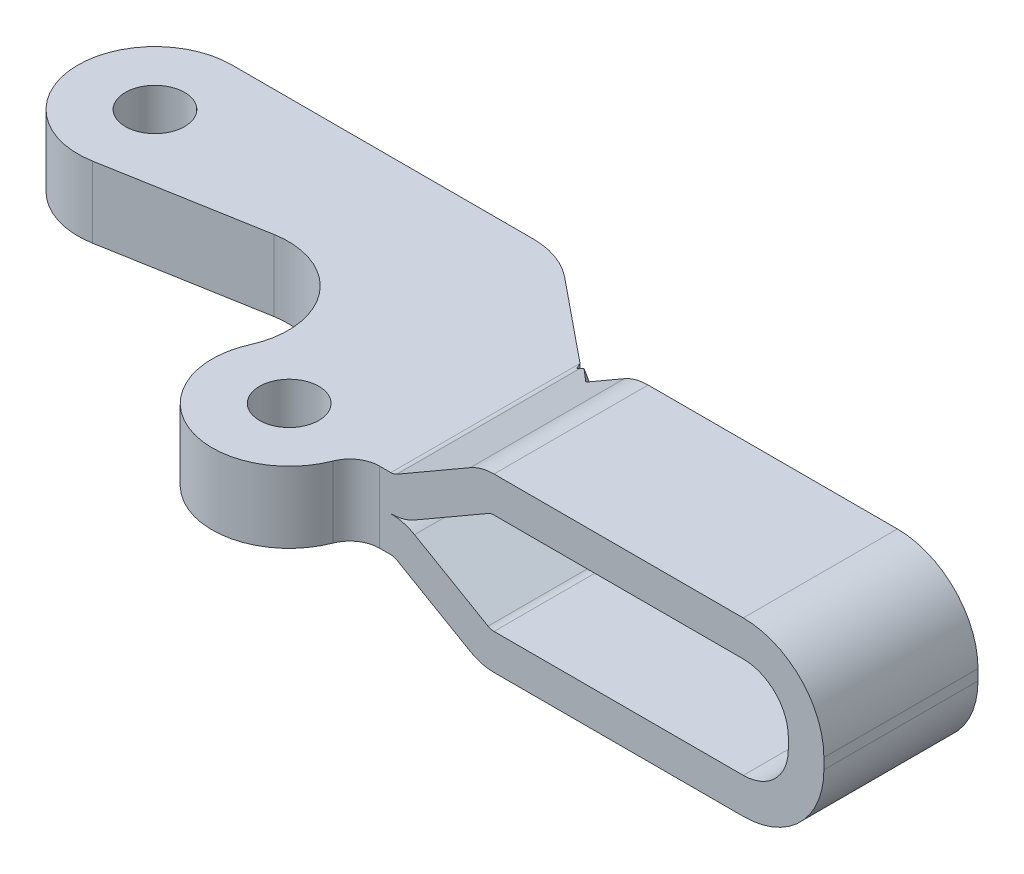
ISO-10303-21;
HEADER;
FILE_DESCRIPTION(('STEP AP214'),'2;1');
FILE_NAME('part.step','',(''),(''),'','','');
FILE_SCHEMA(('AUTOMOTIVE_DESIGN { 1 0 10303 214 1 1 1 1 }'));
ENDSEC;
DATA;
#1=APPLICATION_CONTEXT('core data for automotive mechanical design processes');
#2=APPLICATION_PROTOCOL_DEFINITION('international standard','automotive_design',2000,#1);
#3=PRODUCT_CONTEXT('',#1,'mechanical');
#4=PRODUCT('Part','Part','',(#3));
#5=PRODUCT_RELATED_PRODUCT_CATEGORY('part','',(#4));
#6=PRODUCT_DEFINITION_FORMATION('','',#4);
#7=PRODUCT_DEFINITION_CONTEXT('part definition',#1,'design');
#8=PRODUCT_DEFINITION('design','',#6,#7);
#9=PRODUCT_DEFINITION_SHAPE('','',#8);
#10=(LENGTH_UNIT() NAMED_UNIT(*) SI_UNIT(.MILLI.,.METRE.));
#11=(NAMED_UNIT(*) PLANE_ANGLE_UNIT() SI_UNIT($,.RADIAN.));
#12=(NAMED_UNIT(*) SI_UNIT($,.STERADIAN.) SOLID_ANGLE_UNIT());
#13=UNCERTAINTY_MEASURE_WITH_UNIT(LENGTH_MEASURE(1.E-05),#10,'distance_accuracy_value','');
#14=(GEOMETRIC_REPRESENTATION_CONTEXT(3) GLOBAL_UNCERTAINTY_ASSIGNED_CONTEXT((#13)) GLOBAL_UNIT_ASSIGNED_CONTEXT((#10,
#11,#12)) REPRESENTATION_CONTEXT('',''));
#15=CARTESIAN_POINT('',(0.,0.,0.));
#16=DIRECTION('',(0.,0.,1.));
#17=DIRECTION('',(1.,0.,0.));
#18=AXIS2_PLACEMENT_3D('',#15,#16,#17);
#19=CARTESIAN_POINT('',(36.4761635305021,4.,1.15464715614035));
#20=DIRECTION('',(0.,0.,1.));
#21=DIRECTION('',(0.,1.,0.));
#22=AXIS2_PLACEMENT_3D('',#19,#20,#21);
#23=PLANE('',#22);
#24=CARTESIAN_POINT('',(36.4761635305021,4.,1.15464715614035));
#25=DIRECTION('',(0.,0.,-1.));
#26=DIRECTION('',(0.,-1.,0.));
#27=AXIS2_PLACEMENT_3D('',#24,#25,#26);
#28=CIRCLE('',#27,4.);
#29=CARTESIAN_POINT('',(37.5114397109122,0.136296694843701,1.15464715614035));
#30=VERTEX_POINT('',#29);
#31=CARTESIAN_POINT('',(38.4761635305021,0.535898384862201,1.15464715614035));
#32=VERTEX_POINT('',#31);
#33=EDGE_CURVE('E506',#30,#32,#28,.F.);
#34=ORIENTED_EDGE('',*,*,#33,.F.);
#35=DIRECTION('',(-0.25881904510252,0.965925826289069,0.));
#36=VECTOR('',#35,1.);
#37=CARTESIAN_POINT('',(37.1232111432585,1.58518543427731,1.15464715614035));
#38=LINE('',#37,#36);
#39=CARTESIAN_POINT('',(36.7349825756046,3.0340741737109,1.15464715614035));
#40=VERTEX_POINT('',#39);
#41=EDGE_CURVE('E624',#30,#40,#38,.T.);
#42=ORIENTED_EDGE('',*,*,#41,.T.);
#43=CARTESIAN_POINT('',(36.4761635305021,4.,1.15464715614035));
#44=DIRECTION('',(0.,0.,-1.));
#45=DIRECTION('',(0.,-1.,0.));
#46=AXIS2_PLACEMENT_3D('',#43,#44,#45);
#47=CIRCLE('',#46,1.);
#48=CARTESIAN_POINT('',(36.9761635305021,3.13397459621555,1.15464715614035));
#49=VERTEX_POINT('',#48);
#50=EDGE_CURVE('E508',#40,#49,#47,.F.);
#51=ORIENTED_EDGE('',*,*,#50,.T.);
#52=DIRECTION('',(0.866025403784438,0.5,0.));
#53=VECTOR('',#52,1.);
#54=CARTESIAN_POINT('',(35.0106621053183,1.99919181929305,1.15464715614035));
#55=LINE('',#54,#53);
#56=CARTESIAN_POINT('',(37.3423082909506,3.3453683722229,1.15464715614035));
#57=VERTEX_POINT('',#56);
#58=EDGE_CURVE('E602',#49,#57,#55,.T.);
#59=ORIENTED_EDGE('',*,*,#58,.T.);
#60=DIRECTION('',(0.5,-0.866025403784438,0.));
#61=VECTOR('',#60,1.);
#62=CARTESIAN_POINT('',(37.3423082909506,3.34536837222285,1.15464715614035));
#63=LINE('',#62,#61);
#64=CARTESIAN_POINT('',(38.8423082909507,0.74729216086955,1.15464715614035));
#65=VERTEX_POINT('',#64);
#66=EDGE_CURVE('E584',#57,#65,#63,.T.);
#67=ORIENTED_EDGE('',*,*,#66,.T.);
#68=DIRECTION('',(-0.866025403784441,-0.5,0.));
#69=VECTOR('',#68,1.);
#70=CARTESIAN_POINT('',(38.8423082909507,0.74729216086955,1.15464715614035));
#71=LINE('',#70,#69);
#72=EDGE_CURVE('E498',#65,#32,#71,.T.);
#73=ORIENTED_EDGE('',*,*,#72,.T.);
#74=EDGE_LOOP('',(#34,#42,#51,#59,#67,#73));
#75=FACE_BOUND('',#74,.T.);
#76=ADVANCED_FACE('F14',(#75),#23,.F.);
#77=CARTESIAN_POINT('',(27.1306619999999,3.,15.80758262));
#78=DIRECTION('',(0.,-1.,0.));
#79=DIRECTION('',(1.,0.,0.));
#80=AXIS2_PLACEMENT_3D('',#77,#78,#79);
#81=CYLINDRICAL_SURFACE('',#80,6.5);
#82=CARTESIAN_POINT('',(27.1306619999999,3.,15.80758262));
#83=DIRECTION('',(0.,-1.,0.));
#84=DIRECTION('',(1.,0.,0.));
#85=AXIS2_PLACEMENT_3D('',#82,#83,#84);
#86=CIRCLE('',#85,6.5);
#87=CARTESIAN_POINT('',(33.1864468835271,3.,18.1692492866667));
#88=VERTEX_POINT('',#87);
#89=CARTESIAN_POINT('',(21.1948545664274,3.,13.1587734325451));
#90=VERTEX_POINT('',#89);
#91=EDGE_CURVE('E524',#88,#90,#86,.T.);
#92=ORIENTED_EDGE('',*,*,#91,.T.);
#93=DIRECTION('',(0.,-1.,0.));
#94=VECTOR('',#93,1.);
#95=CARTESIAN_POINT('',(21.1948545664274,3.,13.1587734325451));
#96=LINE('',#95,#94);
#97=CARTESIAN_POINT('',(21.1948545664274,-3.,13.1587734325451));
#98=VERTEX_POINT('',#97);
#99=EDGE_CURVE('E527',#90,#98,#96,.T.);
#100=ORIENTED_EDGE('',*,*,#99,.T.);
#101=CARTESIAN_POINT('',(27.1306619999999,-3.,15.80758262));
#102=DIRECTION('',(0.,-1.,0.));
#103=DIRECTION('',(1.,0.,0.));
#104=AXIS2_PLACEMENT_3D('',#101,#102,#103);
#105=CIRCLE('',#104,6.5);
#106=CARTESIAN_POINT('',(33.1864468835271,-3.,18.1692492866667));
#107=VERTEX_POINT('',#106);
#108=EDGE_CURVE('E271',#107,#98,#105,.T.);
#109=ORIENTED_EDGE('',*,*,#108,.F.);
#110=DIRECTION('',(0.,-1.,0.));
#111=VECTOR('',#110,1.);
#112=CARTESIAN_POINT('',(33.1864468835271,3.,18.1692492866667));
#113=LINE('',#112,#111);
#114=EDGE_CURVE('E528',#107,#88,#113,.F.);
#115=ORIENTED_EDGE('',*,*,#114,.T.);
#116=EDGE_LOOP('',(#92,#100,#109,#115));
#117=FACE_BOUND('',#116,.T.);
#118=ADVANCED_FACE('F438',(#117),#81,.T.);
#119=CARTESIAN_POINT('',(15.259047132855,3.,10.5099642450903));
#120=DIRECTION('',(0.,-1.,0.));
#121=DIRECTION('',(1.,0.,0.));
#122=AXIS2_PLACEMENT_3D('',#119,#120,#121);
#123=CYLINDRICAL_SURFACE('',#122,6.5);
#124=CARTESIAN_POINT('',(15.259047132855,3.,10.5099642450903));
#125=DIRECTION('',(0.,-1.,0.));
#126=DIRECTION('',(1.,0.,0.));
#127=AXIS2_PLACEMENT_3D('',#124,#125,#126);
#128=CIRCLE('',#127,6.5);
#129=CARTESIAN_POINT('',(14.1303339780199,3.,4.10871385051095));
#130=VERTEX_POINT('',#129);
#131=EDGE_CURVE('E529',#130,#90,#128,.T.);
#132=ORIENTED_EDGE('',*,*,#131,.F.);
#133=DIRECTION('',(0.,1.,0.));
#134=VECTOR('',#133,1.);
#135=CARTESIAN_POINT('',(14.1303339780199,3.,4.10871385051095));
#136=LINE('',#135,#134);
#137=CARTESIAN_POINT('',(14.1303339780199,-3.,4.10871385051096));
#138=VERTEX_POINT('',#137);
#139=EDGE_CURVE('E991',#130,#138,#136,.F.);
#140=ORIENTED_EDGE('',*,*,#139,.T.);
#141=CARTESIAN_POINT('',(15.259047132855,-3.,10.5099642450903));
#142=DIRECTION('',(0.,-1.,0.));
#143=DIRECTION('',(1.,0.,0.));
#144=AXIS2_PLACEMENT_3D('',#141,#142,#143);
#145=CIRCLE('',#144,6.5);
#146=EDGE_CURVE('E268',#98,#138,#145,.F.);
#147=ORIENTED_EDGE('',*,*,#146,.F.);
#148=ORIENTED_EDGE('',*,*,#99,.F.);
#149=EDGE_LOOP('',(#132,#140,#147,#148));
#150=FACE_BOUND('',#149,.T.);
#151=ADVANCED_FACE('F940',(#150),#123,.F.);
#152=CARTESIAN_POINT('',(1.128713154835,3.,6.40125039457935));
#153=DIRECTION('',(-0.173648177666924,0.,-0.984807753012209));
#154=DIRECTION('',(-0.984807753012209,0.,0.173648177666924));
#155=AXIS2_PLACEMENT_3D('',#152,#153,#154);
#156=PLANE('',#155);
#157=ORIENTED_EDGE('',*,*,#139,.F.);
#158=DIRECTION('',(-0.984807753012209,0.,0.173648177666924));
#159=VECTOR('',#158,1.);
#160=CARTESIAN_POINT('',(1.128713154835,3.,6.40125039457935));
#161=LINE('',#160,#159);
#162=CARTESIAN_POINT('',(1.128713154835,3.,6.40125039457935));
#163=VERTEX_POINT('',#162);
#164=EDGE_CURVE('E532',#163,#130,#161,.F.);
#165=ORIENTED_EDGE('',*,*,#164,.F.);
#166=DIRECTION('',(0.,-1.,0.));
#167=VECTOR('',#166,1.);
#168=CARTESIAN_POINT('',(1.128713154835,3.,6.40125039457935));
#169=LINE('',#168,#167);
#170=CARTESIAN_POINT('',(1.128713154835,-3.,6.40125039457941));
#171=VERTEX_POINT('',#170);
#172=EDGE_CURVE('E537',#171,#163,#169,.F.);
#173=ORIENTED_EDGE('',*,*,#172,.F.);
#174=DIRECTION('',(-0.984807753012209,0.,0.173648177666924));
#175=VECTOR('',#174,1.);
#176=CARTESIAN_POINT('',(14.1303339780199,-3.,4.10871385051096));
#177=LINE('',#176,#175);
#178=EDGE_CURVE('E267',#138,#171,#177,.T.);
#179=ORIENTED_EDGE('',*,*,#178,.F.);
#180=EDGE_LOOP('',(#157,#165,#173,#179));
#181=FACE_BOUND('',#180,.T.);
#182=ADVANCED_FACE('F931',(#181),#156,.F.);
#183=CARTESIAN_POINT('',(0.,3.,0.));
#184=DIRECTION('',(0.,-1.,0.));
#185=DIRECTION('',(1.,0.,0.));
#186=AXIS2_PLACEMENT_3D('',#183,#184,#185);
#187=CYLINDRICAL_SURFACE('',#186,6.5);
#188=CARTESIAN_POINT('',(0.,3.,0.));
#189=DIRECTION('',(0.,-1.,0.));
#190=DIRECTION('',(1.,0.,0.));
#191=AXIS2_PLACEMENT_3D('',#188,#189,#190);
#192=CIRCLE('',#191,6.5);
#193=CARTESIAN_POINT('',(0.,3.,-6.5));
#194=VERTEX_POINT('',#193);
#195=EDGE_CURVE('E533',#163,#194,#192,.T.);
#196=ORIENTED_EDGE('',*,*,#195,.T.);
#197=DIRECTION('',(0.,1.,0.));
#198=VECTOR('',#197,1.);
#199=CARTESIAN_POINT('',(0.,3.,-6.5));
#200=LINE('',#199,#198);
#201=CARTESIAN_POINT('',(0.,-3.,-6.5));
#202=VERTEX_POINT('',#201);
#203=EDGE_CURVE('E988',#194,#202,#200,.F.);
#204=ORIENTED_EDGE('',*,*,#203,.T.);
#205=CARTESIAN_POINT('',(0.,-3.,0.));
#206=DIRECTION('',(0.,-1.,0.));
#207=DIRECTION('',(1.,0.,0.));
#208=AXIS2_PLACEMENT_3D('',#205,#206,#207);
#209=CIRCLE('',#208,6.5);
#210=EDGE_CURVE('E264',#171,#202,#209,.T.);
#211=ORIENTED_EDGE('',*,*,#210,.F.);
#212=ORIENTED_EDGE('',*,*,#172,.T.);
#213=EDGE_LOOP('',(#196,#204,#211,#212));
#214=FACE_BOUND('',#213,.T.);
#215=ADVANCED_FACE('F922',(#214),#187,.T.);
#216=CARTESIAN_POINT('',(25.4123519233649,3.,-6.5));
#217=DIRECTION('',(0.,0.,1.));
#218=DIRECTION('',(0.,1.,0.));
#219=AXIS2_PLACEMENT_3D('',#216,#217,#218);
#220=PLANE('',#219);
#221=ORIENTED_EDGE('',*,*,#203,.F.);
#222=DIRECTION('',(-1.,0.,0.));
#223=VECTOR('',#222,1.);
#224=CARTESIAN_POINT('',(25.4123519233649,3.,-6.5));
#225=LINE('',#224,#223);
#226=CARTESIAN_POINT('',(25.4123519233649,3.,-6.5));
#227=VERTEX_POINT('',#226);
#228=EDGE_CURVE('E536',#227,#194,#225,.T.);
#229=ORIENTED_EDGE('',*,*,#228,.F.);
#230=DIRECTION('',(0.,-1.,0.));
#231=VECTOR('',#230,1.);
#232=CARTESIAN_POINT('',(25.4123519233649,3.,-6.5));
#233=LINE('',#232,#231);
#234=CARTESIAN_POINT('',(25.4123519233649,-3.,-6.5));
#235=VERTEX_POINT('',#234);
#236=EDGE_CURVE('E542',#235,#227,#233,.F.);
#237=ORIENTED_EDGE('',*,*,#236,.F.);
#238=DIRECTION('',(1.,0.,0.));
#239=VECTOR('',#238,1.);
#240=CARTESIAN_POINT('',(35.515594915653,-3.,-6.5));
#241=LINE('',#240,#239);
#242=EDGE_CURVE('E263',#202,#235,#241,.T.);
#243=ORIENTED_EDGE('',*,*,#242,.F.);
#244=EDGE_LOOP('',(#221,#229,#237,#243));
#245=FACE_BOUND('',#244,.T.);
#246=ADVANCED_FACE('F650',(#245),#220,.F.);
#247=CARTESIAN_POINT('',(39.921286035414,4.83434186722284,3.57758261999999));
#248=DIRECTION('',(-0.546564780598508,-0.315559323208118,0.775686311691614));
#249=DIRECTION('',(0.817453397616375,0.,0.575994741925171));
#250=AXIS2_PLACEMENT_3D('',#247,#248,#249);
#251=PLANE('',#250);
#252=DIRECTION('',(-0.671764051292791,-0.387843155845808,-0.631118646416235));
#253=VECTOR('',#252,1.);
#254=CARTESIAN_POINT('',(39.921286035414,4.83434186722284,3.57758261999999));
#255=LINE('',#254,#253);
#256=CARTESIAN_POINT('',(39.921286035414,4.83434186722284,3.57758261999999));
#257=VERTEX_POINT('',#256);
#258=EDGE_CURVE('E505',#257,#57,#255,.T.);
#259=ORIENTED_EDGE('',*,*,#258,.F.);
#260=DIRECTION('',(0.5,-0.866025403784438,0.));
#261=VECTOR('',#260,1.);
#262=CARTESIAN_POINT('',(39.921286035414,4.83434186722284,3.57758261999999));
#263=LINE('',#262,#261);
#264=CARTESIAN_POINT('',(41.421286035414,2.23626565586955,3.57758262));
#265=VERTEX_POINT('',#264);
#266=EDGE_CURVE('E587',#257,#265,#263,.T.);
#267=ORIENTED_EDGE('',*,*,#266,.T.);
#268=DIRECTION('',(0.671764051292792,0.387843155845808,0.631118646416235));
#269=VECTOR('',#268,1.);
#270=CARTESIAN_POINT('',(38.8423082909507,0.74729216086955,1.15464715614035));
#271=LINE('',#270,#269);
#272=EDGE_CURVE('E578',#65,#265,#271,.T.);
#273=ORIENTED_EDGE('',*,*,#272,.F.);
#274=ORIENTED_EDGE('',*,*,#66,.F.);
#275=EDGE_LOOP('',(#259,#267,#273,#274));
#276=FACE_BOUND('',#275,.T.);
#277=ADVANCED_FACE('F646',(#276),#251,.F.);
#278=CARTESIAN_POINT('',(35.515594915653,3.,19.07758262));
#279=DIRECTION('',(0.,-1.,0.));
#280=DIRECTION('',(1.,0.,0.));
#281=AXIS2_PLACEMENT_3D('',#278,#279,#280);
#282=CYLINDRICAL_SURFACE('',#281,2.5);
#283=DIRECTION('',(0.,-1.,0.));
#284=VECTOR('',#283,1.);
#285=CARTESIAN_POINT('',(35.515594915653,3.,16.57758262));
#286=LINE('',#285,#284);
#287=CARTESIAN_POINT('',(35.515594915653,3.,16.57758262));
#288=VERTEX_POINT('',#287);
#289=CARTESIAN_POINT('',(35.515594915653,-3.,16.57758262));
#290=VERTEX_POINT('',#289);
#291=EDGE_CURVE('E523',#288,#290,#286,.T.);
#292=ORIENTED_EDGE('',*,*,#291,.F.);
#293=CARTESIAN_POINT('',(35.515594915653,3.,19.07758262));
#294=DIRECTION('',(0.,-1.,0.));
#295=DIRECTION('',(1.,0.,0.));
#296=AXIS2_PLACEMENT_3D('',#293,#294,#295);
#297=CIRCLE('',#296,2.5);
#298=EDGE_CURVE('E519',#88,#288,#297,.T.);
#299=ORIENTED_EDGE('',*,*,#298,.F.);
#300=ORIENTED_EDGE('',*,*,#114,.F.);
#301=CARTESIAN_POINT('',(35.515594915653,-3.,19.07758262));
#302=DIRECTION('',(0.,-1.,0.));
#303=DIRECTION('',(1.,0.,0.));
#304=AXIS2_PLACEMENT_3D('',#301,#302,#303);
#305=CIRCLE('',#304,2.5);
#306=EDGE_CURVE('E274',#290,#107,#305,.F.);
#307=ORIENTED_EDGE('',*,*,#306,.F.);
#308=EDGE_LOOP('',(#292,#299,#300,#307));
#309=FACE_BOUND('',#308,.T.);
#310=ADVANCED_FACE('F649',(#309),#282,.F.);
#311=CARTESIAN_POINT('',(35.515594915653,3.,19.07758262));
#312=DIRECTION('',(0.,-1.,0.));
#313=DIRECTION('',(1.,0.,0.));
#314=AXIS2_PLACEMENT_3D('',#311,#312,#313);
#315=PLANE('',#314);
#316=DIRECTION('',(0.,0.,1.));
#317=VECTOR('',#316,1.);
#318=CARTESIAN_POINT('',(36.4761635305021,3.,19.07758262));
#319=LINE('',#318,#317);
#320=CARTESIAN_POINT('',(36.4761635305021,3.,0.622130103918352));
#321=VERTEX_POINT('',#320);
#322=CARTESIAN_POINT('',(36.4761635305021,3.,16.57758262));
#323=VERTEX_POINT('',#322);
#324=EDGE_CURVE('E980',#321,#323,#319,.T.);
#325=ORIENTED_EDGE('',*,*,#324,.F.);
#326=DIRECTION('',(0.775686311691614,0.,0.631118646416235));
#327=VECTOR('',#326,1.);
#328=CARTESIAN_POINT('',(40.10860899,3.,3.57758262));
#329=LINE('',#328,#327);
#330=CARTESIAN_POINT('',(29.5146231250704,3.,-5.04196102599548));
#331=VERTEX_POINT('',#330);
#332=EDGE_CURVE('E546',#321,#331,#329,.F.);
#333=ORIENTED_EDGE('',*,*,#332,.T.);
#334=CARTESIAN_POINT('',(25.4123519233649,3.,0.));
#335=DIRECTION('',(0.,-1.,0.));
#336=DIRECTION('',(1.,0.,0.));
#337=AXIS2_PLACEMENT_3D('',#334,#335,#336);
#338=CIRCLE('',#337,6.5);
#339=EDGE_CURVE('E538',#227,#331,#338,.T.);
#340=ORIENTED_EDGE('',*,*,#339,.F.);
#341=ORIENTED_EDGE('',*,*,#228,.T.);
#342=ORIENTED_EDGE('',*,*,#195,.F.);
#343=ORIENTED_EDGE('',*,*,#164,.T.);
#344=ORIENTED_EDGE('',*,*,#131,.T.);
#345=ORIENTED_EDGE('',*,*,#91,.F.);
#346=ORIENTED_EDGE('',*,*,#298,.T.);
#347=DIRECTION('',(1.,0.,0.));
#348=VECTOR('',#347,1.);
#349=CARTESIAN_POINT('',(35.515594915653,3.,16.57758262));
#350=LINE('',#349,#348);
#351=EDGE_CURVE('E971',#323,#288,#350,.F.);
#352=ORIENTED_EDGE('',*,*,#351,.F.);
#353=EDGE_LOOP('',(#325,#333,#340,#341,#342,#343,#344,#345,#346,#352));
#354=FACE_BOUND('',#353,.T.);
#355=CARTESIAN_POINT('',(0.,3.,0.));
#356=DIRECTION('',(0.,-1.,0.));
#357=DIRECTION('',(1.,0.,0.));
#358=AXIS2_PLACEMENT_3D('',#355,#356,#357);
#359=CIRCLE('',#358,2.5);
#360=CARTESIAN_POINT('',(2.5,3.,0.));
#361=VERTEX_POINT('',#360);
#362=EDGE_CURVE('E543',#361,#361,#359,.T.);
#363=ORIENTED_EDGE('',*,*,#362,.T.);
#364=EDGE_LOOP('',(#363));
#365=FACE_BOUND('',#364,.T.);
#366=CARTESIAN_POINT('',(27.1306619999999,3.,15.80758262));
#367=DIRECTION('',(0.,-1.,0.));
#368=DIRECTION('',(1.,0.,0.));
#369=AXIS2_PLACEMENT_3D('',#366,#367,#368);
#370=CIRCLE('',#369,2.5);
#371=CARTESIAN_POINT('',(29.6306619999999,3.,15.80758262));
#372=VERTEX_POINT('',#371);
#373=EDGE_CURVE('E26',#372,#372,#370,.T.);
#374=ORIENTED_EDGE('',*,*,#373,.T.);
#375=EDGE_LOOP('',(#374));
#376=FACE_BOUND('',#375,.T.);
#377=ADVANCED_FACE('F636',(#354,#365,#376),#315,.F.);
#378=CARTESIAN_POINT('',(36.4761635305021,4.,24.8875798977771));
#379=DIRECTION('',(0.,0.,-1.));
#380=DIRECTION('',(0.,-1.,0.));
#381=AXIS2_PLACEMENT_3D('',#378,#379,#380);
#382=CYLINDRICAL_SURFACE('',#381,1.);
#383=ORIENTED_EDGE('',*,*,#324,.T.);
#384=CARTESIAN_POINT('',(36.4761635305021,4.,16.57758262));
#385=DIRECTION('',(0.,0.,-1.));
#386=DIRECTION('',(0.,-1.,0.));
#387=AXIS2_PLACEMENT_3D('',#384,#385,#386);
#388=CIRCLE('',#387,1.);
#389=CARTESIAN_POINT('',(36.9761635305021,3.13397459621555,16.57758262));
#390=VERTEX_POINT('',#389);
#391=EDGE_CURVE('E512',#323,#390,#388,.F.);
#392=ORIENTED_EDGE('',*,*,#391,.T.);
#393=DIRECTION('',(0.,0.,-1.));
#394=VECTOR('',#393,1.);
#395=CARTESIAN_POINT('',(36.9761635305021,3.13397459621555,24.8875798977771));
#396=LINE('',#395,#394);
#397=EDGE_CURVE('E511',#49,#390,#396,.F.);
#398=ORIENTED_EDGE('',*,*,#397,.F.);
#399=ORIENTED_EDGE('',*,*,#50,.F.);
#400=CARTESIAN_POINT('',(36.4761635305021,3.,0.622130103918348));
#401=CARTESIAN_POINT('',(36.4870718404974,2.99999993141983,0.644318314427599));
#402=CARTESIAN_POINT('',(36.4979801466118,3.00017848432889,0.666506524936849));
#403=CARTESIAN_POINT('',(36.5197850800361,3.00089234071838,0.71088294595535));
#404=CARTESIAN_POINT('',(36.530681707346,3.00142764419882,0.733071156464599));
#405=CARTESIAN_POINT('',(36.5524516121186,3.00285450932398,0.777447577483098));
#406=CARTESIAN_POINT('',(36.5633248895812,3.00374607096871,0.799635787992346));
#407=CARTESIAN_POINT('',(36.5850364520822,3.0058844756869,0.844012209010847));
#408=CARTESIAN_POINT('',(36.5958747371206,3.00713131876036,0.866200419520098));
#409=CARTESIAN_POINT('',(36.6175047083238,3.00997895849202,0.9105768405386));
#410=CARTESIAN_POINT('',(36.6282963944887,3.0115797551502,0.93276505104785));
#411=CARTESIAN_POINT('',(36.6498216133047,3.01513358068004,0.97714147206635));
#412=CARTESIAN_POINT('',(36.6605551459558,3.01708660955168,0.999329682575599));
#413=CARTESIAN_POINT('',(36.6819525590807,3.02134282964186,1.0437061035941));
#414=CARTESIAN_POINT('',(36.6926164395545,3.0236460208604,1.06589431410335));
#415=CARTESIAN_POINT('',(36.7138631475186,3.02860002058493,1.11027073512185));
#416=CARTESIAN_POINT('',(36.724445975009,3.03125082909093,1.1324589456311));
#417=CARTESIAN_POINT('',(36.7349825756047,3.03407417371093,1.15464715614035));
#418=B_SPLINE_CURVE_WITH_KNOTS('',3,(#400,#401,#402,#403,#404,#405,#406,#407,#408,#409,#410,
#411,#412,#413,#414,#415,#416,#417),.UNSPECIFIED.,.F.,.F.,(4,2,2,2,2,2,2,2,4),(0.,
0.0741732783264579,0.148346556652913,0.222519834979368,0.296693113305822,0.370866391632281,
0.445039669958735,0.51921294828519,0.593386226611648),.UNSPECIFIED.);
#419=EDGE_CURVE('E515',#40,#321,#418,.F.);
#420=ORIENTED_EDGE('',*,*,#419,.T.);
#421=EDGE_LOOP('',(#383,#392,#398,#399,#420));
#422=FACE_BOUND('',#421,.T.);
#423=ADVANCED_FACE('F626',(#422),#382,.F.);
#424=CARTESIAN_POINT('',(35.0106621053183,1.99919181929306,19.07758262));
#425=DIRECTION('',(0.5,-0.866025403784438,0.));
#426=DIRECTION('',(0.866025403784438,0.5,0.));
#427=AXIS2_PLACEMENT_3D('',#424,#425,#426);
#428=PLANE('',#427);
#429=DIRECTION('',(0.,0.,1.));
#430=VECTOR('',#429,1.);
#431=CARTESIAN_POINT('',(43.1771254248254,6.71410161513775,19.07758262));
#432=LINE('',#431,#430);
#433=CARTESIAN_POINT('',(43.1771254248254,6.71410161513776,3.57758262));
#434=VERTEX_POINT('',#433);
#435=CARTESIAN_POINT('',(43.1771254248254,6.71410161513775,16.57758262));
#436=VERTEX_POINT('',#435);
#437=EDGE_CURVE('E502',#434,#436,#432,.T.);
#438=ORIENTED_EDGE('',*,*,#437,.F.);
#439=DIRECTION('',(-0.866025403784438,-0.5,0.));
#440=VECTOR('',#439,1.);
#441=CARTESIAN_POINT('',(43.1771254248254,6.71410161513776,3.57758262));
#442=LINE('',#441,#440);
#443=EDGE_CURVE('E598',#434,#257,#442,.T.);
#444=ORIENTED_EDGE('',*,*,#443,.T.);
#445=ORIENTED_EDGE('',*,*,#258,.T.);
#446=ORIENTED_EDGE('',*,*,#58,.F.);
#447=ORIENTED_EDGE('',*,*,#397,.T.);
#448=DIRECTION('',(0.866025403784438,0.5,0.));
#449=VECTOR('',#448,1.);
#450=CARTESIAN_POINT('',(36.9761635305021,3.13397459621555,16.57758262));
#451=LINE('',#450,#449);
#452=EDGE_CURVE('E509',#390,#436,#451,.T.);
#453=ORIENTED_EDGE('',*,*,#452,.T.);
#454=EDGE_LOOP('',(#438,#444,#445,#446,#447,#453));
#455=FACE_BOUND('',#454,.T.);
#456=ADVANCED_FACE('F635',(#455),#428,.F.);
#457=CARTESIAN_POINT('',(45.1771254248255,3.25,23.7346401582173));
#458=DIRECTION('',(0.,0.,-1.));
#459=DIRECTION('',(0.,-1.,0.));
#460=AXIS2_PLACEMENT_3D('',#457,#458,#459);
#461=CYLINDRICAL_SURFACE('',#460,4.);
#462=CARTESIAN_POINT('',(45.1771254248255,3.25,16.57758262));
#463=DIRECTION('',(0.,0.,-1.));
#464=DIRECTION('',(0.,-1.,0.));
#465=AXIS2_PLACEMENT_3D('',#462,#463,#464);
#466=CIRCLE('',#465,4.);
#467=CARTESIAN_POINT('',(45.1771254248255,7.25,16.57758262));
#468=VERTEX_POINT('',#467);
#469=EDGE_CURVE('E494',#468,#436,#466,.F.);
#470=ORIENTED_EDGE('',*,*,#469,.F.);
#471=DIRECTION('',(0.,0.,-1.));
#472=VECTOR('',#471,1.);
#473=CARTESIAN_POINT('',(45.1771254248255,7.25,23.7346401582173));
#474=LINE('',#473,#472);
#475=CARTESIAN_POINT('',(45.1771254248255,7.25,3.57758262));
#476=VERTEX_POINT('',#475);
#477=EDGE_CURVE('E569',#468,#476,#474,.T.);
#478=ORIENTED_EDGE('',*,*,#477,.T.);
#479=CARTESIAN_POINT('',(45.1771254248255,3.25,3.57758262));
#480=DIRECTION('',(0.,0.,-1.));
#481=DIRECTION('',(0.,-1.,0.));
#482=AXIS2_PLACEMENT_3D('',#479,#480,#481);
#483=CIRCLE('',#482,4.);
#484=EDGE_CURVE('E491',#434,#476,#483,.T.);
#485=ORIENTED_EDGE('',*,*,#484,.F.);
#486=ORIENTED_EDGE('',*,*,#437,.T.);
#487=EDGE_LOOP('',(#470,#478,#485,#486));
#488=FACE_BOUND('',#487,.T.);
#489=ADVANCED_FACE('F659',(#488),#461,.T.);
#490=CARTESIAN_POINT('',(34.4383088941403,7.25,19.07758262));
#491=DIRECTION('',(0.,-1.,0.));
#492=DIRECTION('',(1.,0.,0.));
#493=AXIS2_PLACEMENT_3D('',#490,#491,#492);
#494=PLANE('',#493);
#495=DIRECTION('',(0.,0.,1.));
#496=VECTOR('',#495,1.);
#497=CARTESIAN_POINT('',(66.2029846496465,7.25,19.07758262));
#498=LINE('',#497,#496);
#499=CARTESIAN_POINT('',(66.2029846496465,7.25,3.57758262));
#500=VERTEX_POINT('',#499);
#501=CARTESIAN_POINT('',(66.2029846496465,7.25,16.57758262));
#502=VERTEX_POINT('',#501);
#503=EDGE_CURVE('E485',#500,#502,#498,.T.);
#504=ORIENTED_EDGE('',*,*,#503,.F.);
#505=DIRECTION('',(1.,0.,0.));
#506=VECTOR('',#505,1.);
#507=CARTESIAN_POINT('',(40.10860899,7.25,3.57758262));
#508=LINE('',#507,#506);
#509=EDGE_CURVE('E560',#500,#476,#508,.F.);
#510=ORIENTED_EDGE('',*,*,#509,.T.);
#511=ORIENTED_EDGE('',*,*,#477,.F.);
#512=DIRECTION('',(-1.,0.,0.));
#513=VECTOR('',#512,1.);
#514=CARTESIAN_POINT('',(74.4383088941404,7.25,16.57758262));
#515=LINE('',#514,#513);
#516=EDGE_CURVE('E571',#468,#502,#515,.F.);
#517=ORIENTED_EDGE('',*,*,#516,.T.);
#518=EDGE_LOOP('',(#504,#510,#511,#517));
#519=FACE_BOUND('',#518,.T.);
#520=ADVANCED_FACE('F667',(#519),#494,.F.);
#521=CARTESIAN_POINT('',(66.2029846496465,0.45,25.8036532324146));
#522=DIRECTION('',(0.,0.,-1.));
#523=DIRECTION('',(0.,-1.,0.));
#524=AXIS2_PLACEMENT_3D('',#521,#522,#523);
#525=CYLINDRICAL_SURFACE('',#524,6.8);
#526=ORIENTED_EDGE('',*,*,#503,.T.);
#527=CARTESIAN_POINT('',(66.2029846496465,0.45,16.57758262));
#528=DIRECTION('',(0.,0.,-1.));
#529=DIRECTION('',(0.,-1.,0.));
#530=AXIS2_PLACEMENT_3D('',#527,#528,#529);
#531=CIRCLE('',#530,6.8);
#532=CARTESIAN_POINT('',(73.0029846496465,0.45,16.57758262));
#533=VERTEX_POINT('',#532);
#534=EDGE_CURVE('E482',#533,#502,#531,.F.);
#535=ORIENTED_EDGE('',*,*,#534,.F.);
#536=DIRECTION('',(0.,0.,-1.));
#537=VECTOR('',#536,1.);
#538=CARTESIAN_POINT('',(73.0029846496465,0.449999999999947,25.8036532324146));
#539=LINE('',#538,#537);
#540=CARTESIAN_POINT('',(73.0029846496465,0.44999999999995,3.57758262));
#541=VERTEX_POINT('',#540);
#542=EDGE_CURVE('E321',#533,#541,#539,.T.);
#543=ORIENTED_EDGE('',*,*,#542,.T.);
#544=CARTESIAN_POINT('',(66.2029846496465,0.45,3.57758262));
#545=DIRECTION('',(0.,0.,-1.));
#546=DIRECTION('',(0.,-1.,0.));
#547=AXIS2_PLACEMENT_3D('',#544,#545,#546);
#548=CIRCLE('',#547,6.8);
#549=EDGE_CURVE('E479',#500,#541,#548,.T.);
#550=ORIENTED_EDGE('',*,*,#549,.F.);
#551=EDGE_LOOP('',(#526,#535,#543,#550));
#552=FACE_BOUND('',#551,.T.);
#553=ADVANCED_FACE('F675',(#552),#525,.T.);
#554=CARTESIAN_POINT('',(73.0029846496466,40.539896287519,19.07758262));
#555=DIRECTION('',(-1.,0.,0.));
#556=DIRECTION('',(0.,-1.,0.));
#557=AXIS2_PLACEMENT_3D('',#554,#555,#556);
#558=PLANE('',#557);
#559=DIRECTION('',(0.,-1.,0.));
#560=VECTOR('',#559,1.);
#561=CARTESIAN_POINT('',(73.0029846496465,0.539896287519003,16.57758262));
#562=LINE('',#561,#560);
#563=CARTESIAN_POINT('',(73.0029846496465,-0.45,16.57758262));
#564=VERTEX_POINT('',#563);
#565=EDGE_CURVE('E320',#533,#564,#562,.T.);
#566=ORIENTED_EDGE('',*,*,#565,.T.);
#567=DIRECTION('',(0.,0.,-1.));
#568=VECTOR('',#567,1.);
#569=CARTESIAN_POINT('',(73.0029846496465,-0.45,25.8036532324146));
#570=LINE('',#569,#568);
#571=CARTESIAN_POINT('',(73.0029846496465,-0.45,3.57758262));
#572=VERTEX_POINT('',#571);
#573=EDGE_CURVE('E228',#572,#564,#570,.F.);
#574=ORIENTED_EDGE('',*,*,#573,.F.);
#575=DIRECTION('',(0.,1.,0.));
#576=VECTOR('',#575,1.);
#577=CARTESIAN_POINT('',(73.0029846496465,34.8695961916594,3.57758262));
#578=LINE('',#577,#576);
#579=EDGE_CURVE('E255',#572,#541,#578,.T.);
#580=ORIENTED_EDGE('',*,*,#579,.T.);
#581=ORIENTED_EDGE('',*,*,#542,.F.);
#582=EDGE_LOOP('',(#566,#574,#580,#581));
#583=FACE_BOUND('',#582,.T.);
#584=ADVANCED_FACE('F317',(#583),#558,.F.);
#585=CARTESIAN_POINT('',(70.0029846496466,40.539896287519,19.07758262));
#586=DIRECTION('',(-1.,0.,0.));
#587=DIRECTION('',(0.,-1.,0.));
#588=AXIS2_PLACEMENT_3D('',#585,#586,#587);
#589=PLANE('',#588);
#590=DIRECTION('',(0.,0.,-1.));
#591=VECTOR('',#590,1.);
#592=CARTESIAN_POINT('',(70.0029846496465,0.45,25.8036532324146));
#593=LINE('',#592,#591);
#594=CARTESIAN_POINT('',(70.0029846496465,0.45,16.57758262));
#595=VERTEX_POINT('',#594);
#596=CARTESIAN_POINT('',(70.0029846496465,0.449999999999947,3.57758262));
#597=VERTEX_POINT('',#596);
#598=EDGE_CURVE('E490',#595,#597,#593,.T.);
#599=ORIENTED_EDGE('',*,*,#598,.T.);
#600=DIRECTION('',(0.,-1.,0.));
#601=VECTOR('',#600,1.);
#602=CARTESIAN_POINT('',(70.0029846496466,40.539896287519,3.57758261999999));
#603=LINE('',#602,#601);
#604=CARTESIAN_POINT('',(70.0029846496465,-0.45,3.57758262));
#605=VERTEX_POINT('',#604);
#606=EDGE_CURVE('E483',#597,#605,#603,.T.);
#607=ORIENTED_EDGE('',*,*,#606,.T.);
#608=DIRECTION('',(0.,0.,-1.));
#609=VECTOR('',#608,1.);
#610=CARTESIAN_POINT('',(70.0029846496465,-0.45,25.8036532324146));
#611=LINE('',#610,#609);
#612=CARTESIAN_POINT('',(70.0029846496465,-0.45,16.57758262));
#613=VERTEX_POINT('',#612);
#614=EDGE_CURVE('E247',#605,#613,#611,.F.);
#615=ORIENTED_EDGE('',*,*,#614,.T.);
#616=DIRECTION('',(0.,-1.,0.));
#617=VECTOR('',#616,1.);
#618=CARTESIAN_POINT('',(70.0029846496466,40.539896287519,16.57758262));
#619=LINE('',#618,#617);
#620=EDGE_CURVE('E245',#613,#595,#619,.F.);
#621=ORIENTED_EDGE('',*,*,#620,.T.);
#622=EDGE_LOOP('',(#599,#607,#615,#621));
#623=FACE_BOUND('',#622,.T.);
#624=ADVANCED_FACE('F671',(#623),#589,.T.);
#625=CARTESIAN_POINT('',(66.2029846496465,0.45,25.8036532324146));
#626=DIRECTION('',(0.,0.,-1.));
#627=DIRECTION('',(0.,-1.,0.));
#628=AXIS2_PLACEMENT_3D('',#625,#626,#627);
#629=CYLINDRICAL_SURFACE('',#628,3.8);
#630=CARTESIAN_POINT('',(66.2029846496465,0.45,16.57758262));
#631=DIRECTION('',(0.,0.,-1.));
#632=DIRECTION('',(0.,-1.,0.));
#633=AXIS2_PLACEMENT_3D('',#630,#631,#632);
#634=CIRCLE('',#633,3.8);
#635=CARTESIAN_POINT('',(66.2029846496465,4.25,16.57758262));
#636=VERTEX_POINT('',#635);
#637=EDGE_CURVE('E488',#636,#595,#634,.T.);
#638=ORIENTED_EDGE('',*,*,#637,.F.);
#639=DIRECTION('',(0.,0.,1.));
#640=VECTOR('',#639,1.);
#641=CARTESIAN_POINT('',(66.2029846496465,4.25,19.07758262));
#642=LINE('',#641,#640);
#643=CARTESIAN_POINT('',(66.2029846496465,4.25,3.57758262));
#644=VERTEX_POINT('',#643);
#645=EDGE_CURVE('E565',#644,#636,#642,.T.);
#646=ORIENTED_EDGE('',*,*,#645,.F.);
#647=CARTESIAN_POINT('',(66.2029846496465,0.45,3.57758262));
#648=DIRECTION('',(0.,0.,-1.));
#649=DIRECTION('',(0.,-1.,0.));
#650=AXIS2_PLACEMENT_3D('',#647,#648,#649);
#651=CIRCLE('',#650,3.8);
#652=EDGE_CURVE('E486',#597,#644,#651,.F.);
#653=ORIENTED_EDGE('',*,*,#652,.F.);
#654=ORIENTED_EDGE('',*,*,#598,.F.);
#655=EDGE_LOOP('',(#638,#646,#653,#654));
#656=FACE_BOUND('',#655,.T.);
#657=ADVANCED_FACE('F663',(#656),#629,.F.);
#658=CARTESIAN_POINT('',(34.4383088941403,4.25,19.07758262));
#659=DIRECTION('',(0.,-1.,0.));
#660=DIRECTION('',(1.,0.,0.));
#661=AXIS2_PLACEMENT_3D('',#658,#659,#660);
#662=PLANE('',#661);
#663=DIRECTION('',(0.,0.,-1.));
#664=VECTOR('',#663,1.);
#665=CARTESIAN_POINT('',(45.1771254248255,4.25,23.7346401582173));
#666=LINE('',#665,#664);
#667=CARTESIAN_POINT('',(45.1771254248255,4.25,16.57758262));
#668=VERTEX_POINT('',#667);
#669=CARTESIAN_POINT('',(45.1771254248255,4.25,3.57758262));
#670=VERTEX_POINT('',#669);
#671=EDGE_CURVE('E501',#668,#670,#666,.T.);
#672=ORIENTED_EDGE('',*,*,#671,.T.);
#673=DIRECTION('',(1.,0.,0.));
#674=VECTOR('',#673,1.);
#675=CARTESIAN_POINT('',(34.4383088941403,4.25,3.57758262));
#676=LINE('',#675,#674);
#677=EDGE_CURVE('E495',#670,#644,#676,.T.);
#678=ORIENTED_EDGE('',*,*,#677,.T.);
#679=ORIENTED_EDGE('',*,*,#645,.T.);
#680=DIRECTION('',(1.,0.,0.));
#681=VECTOR('',#680,1.);
#682=CARTESIAN_POINT('',(34.4383088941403,4.25,16.57758262));
#683=LINE('',#682,#681);
#684=EDGE_CURVE('E568',#636,#668,#683,.F.);
#685=ORIENTED_EDGE('',*,*,#684,.T.);
#686=EDGE_LOOP('',(#672,#678,#679,#685));
#687=FACE_BOUND('',#686,.T.);
#688=ADVANCED_FACE('F655',(#687),#662,.T.);
#689=CARTESIAN_POINT('',(45.1771254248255,3.25,23.7346401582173));
#690=DIRECTION('',(0.,0.,-1.));
#691=DIRECTION('',(0.,-1.,0.));
#692=AXIS2_PLACEMENT_3D('',#689,#690,#691);
#693=CYLINDRICAL_SURFACE('',#692,1.);
#694=ORIENTED_EDGE('',*,*,#671,.F.);
#695=CARTESIAN_POINT('',(45.1771254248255,3.25,16.57758262));
#696=DIRECTION('',(0.,0.,-1.));
#697=DIRECTION('',(0.,-1.,0.));
#698=AXIS2_PLACEMENT_3D('',#695,#696,#697);
#699=CIRCLE('',#698,1.);
#700=CARTESIAN_POINT('',(44.6771254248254,4.1160254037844,16.57758262));
#701=VERTEX_POINT('',#700);
#702=EDGE_CURVE('E499',#701,#668,#699,.T.);
#703=ORIENTED_EDGE('',*,*,#702,.F.);
#704=DIRECTION('',(0.,0.,1.));
#705=VECTOR('',#704,1.);
#706=CARTESIAN_POINT('',(44.6771254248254,4.11602540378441,19.07758262));
#707=LINE('',#706,#705);
#708=CARTESIAN_POINT('',(44.6771254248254,4.1160254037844,3.57758262));
#709=VERTEX_POINT('',#708);
#710=EDGE_CURVE('E613',#709,#701,#707,.T.);
#711=ORIENTED_EDGE('',*,*,#710,.F.);
#712=CARTESIAN_POINT('',(45.1771254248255,3.25,3.57758262));
#713=DIRECTION('',(0.,0.,-1.));
#714=DIRECTION('',(0.,-1.,0.));
#715=AXIS2_PLACEMENT_3D('',#712,#713,#714);
#716=CIRCLE('',#715,1.);
#717=EDGE_CURVE('E503',#670,#709,#716,.F.);
#718=ORIENTED_EDGE('',*,*,#717,.F.);
#719=EDGE_LOOP('',(#694,#703,#711,#718));
#720=FACE_BOUND('',#719,.T.);
#721=ADVANCED_FACE('F652',(#720),#693,.F.);
#722=CARTESIAN_POINT('',(36.5106621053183,-0.59888439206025,19.07758262));
#723=DIRECTION('',(0.5,-0.866025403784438,0.));
#724=DIRECTION('',(0.866025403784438,0.5,0.));
#725=AXIS2_PLACEMENT_3D('',#722,#723,#724);
#726=PLANE('',#725);
#727=ORIENTED_EDGE('',*,*,#272,.T.);
#728=DIRECTION('',(0.866025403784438,0.5,0.));
#729=VECTOR('',#728,1.);
#730=CARTESIAN_POINT('',(36.5106621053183,-0.59888439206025,3.57758262));
#731=LINE('',#730,#729);
#732=EDGE_CURVE('E516',#265,#709,#731,.T.);
#733=ORIENTED_EDGE('',*,*,#732,.T.);
#734=ORIENTED_EDGE('',*,*,#710,.T.);
#735=DIRECTION('',(0.866025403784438,0.5,0.));
#736=VECTOR('',#735,1.);
#737=CARTESIAN_POINT('',(36.5106621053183,-0.598884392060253,16.57758262));
#738=LINE('',#737,#736);
#739=CARTESIAN_POINT('',(38.4761635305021,0.535898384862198,16.57758262));
#740=VERTEX_POINT('',#739);
#741=EDGE_CURVE('E581',#701,#740,#738,.F.);
#742=ORIENTED_EDGE('',*,*,#741,.T.);
#743=DIRECTION('',(0.,0.,-1.));
#744=VECTOR('',#743,1.);
#745=CARTESIAN_POINT('',(38.4761635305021,0.535898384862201,24.8875798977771));
#746=LINE('',#745,#744);
#747=EDGE_CURVE('E520',#32,#740,#746,.F.);
#748=ORIENTED_EDGE('',*,*,#747,.F.);
#749=ORIENTED_EDGE('',*,*,#72,.F.);
#750=EDGE_LOOP('',(#727,#733,#734,#742,#748,#749));
#751=FACE_BOUND('',#750,.T.);
#752=ADVANCED_FACE('F638',(#751),#726,.T.);
#753=CARTESIAN_POINT('',(36.4761635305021,4.,24.8875798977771));
#754=DIRECTION('',(0.,0.,-1.));
#755=DIRECTION('',(0.,-1.,0.));
#756=AXIS2_PLACEMENT_3D('',#753,#754,#755);
#757=CYLINDRICAL_SURFACE('',#756,4.);
#758=CARTESIAN_POINT('',(36.4761635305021,4.,16.57758262));
#759=DIRECTION('',(0.,0.,-1.));
#760=DIRECTION('',(0.,-1.,0.));
#761=AXIS2_PLACEMENT_3D('',#758,#759,#760);
#762=CIRCLE('',#761,4.);
#763=CARTESIAN_POINT('',(36.4761635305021,0.,16.57758262));
#764=VERTEX_POINT('',#763);
#765=EDGE_CURVE('E517',#740,#764,#762,.T.);
#766=ORIENTED_EDGE('',*,*,#765,.T.);
#767=DIRECTION('',(0.,0.,1.));
#768=VECTOR('',#767,1.);
#769=CARTESIAN_POINT('',(36.4761635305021,0.,19.07758262));
#770=LINE('',#769,#768);
#771=CARTESIAN_POINT('',(36.4761635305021,0.,0.622130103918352));
#772=VERTEX_POINT('',#771);
#773=EDGE_CURVE('E9',#772,#764,#770,.T.);
#774=ORIENTED_EDGE('',*,*,#773,.F.);
#775=CARTESIAN_POINT('',(36.4761635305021,0.,0.622130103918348));
#776=CARTESIAN_POINT('',(36.519796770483,-2.74320681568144E-07,0.644318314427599));
#777=CARTESIAN_POINT('',(36.5634299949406,0.000713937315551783,0.66650652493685));
#778=CARTESIAN_POINT('',(36.6506497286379,0.00356936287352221,0.71088294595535));
#779=CARTESIAN_POINT('',(36.6942362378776,0.00571057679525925,0.7330711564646));
#780=CARTESIAN_POINT('',(36.7813158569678,0.011418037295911,0.777447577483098));
#781=CARTESIAN_POINT('',(36.8248089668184,0.0149842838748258,0.799635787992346));
#782=CARTESIAN_POINT('',(36.9116552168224,0.0235379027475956,0.844012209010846));
#783=CARTESIAN_POINT('',(36.9550083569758,0.0285252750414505,0.866200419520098));
#784=CARTESIAN_POINT('',(37.0415282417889,0.0399158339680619,0.9105768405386));
#785=CARTESIAN_POINT('',(37.0846949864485,0.0463190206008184,0.932765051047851));
#786=CARTESIAN_POINT('',(37.1707958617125,0.060534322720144,0.97714147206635));
#787=CARTESIAN_POINT('',(37.2137299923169,0.068346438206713,0.999329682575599));
#788=CARTESIAN_POINT('',(37.2993196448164,0.085371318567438,1.0437061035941));
#789=CARTESIAN_POINT('',(37.3419751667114,0.0945840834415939,1.06589431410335));
#790=CARTESIAN_POINT('',(37.4269619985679,0.114400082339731,1.11027073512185));
#791=CARTESIAN_POINT('',(37.4692933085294,0.125003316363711,1.1324589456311));
#792=CARTESIAN_POINT('',(37.5114397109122,0.136296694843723,1.15464715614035));
#793=B_SPLINE_CURVE_WITH_KNOTS('',3,(#775,#776,#777,#778,#779,#780,#781,#782,#783,#784,#785,
#786,#787,#788,#789,#790,#791,#792),.UNSPECIFIED.,.F.,.F.,(4,2,2,2,2,2,2,2,4),(0.,
0.146847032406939,0.293694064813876,0.440541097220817,0.587388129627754,0.734235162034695,
0.881082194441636,1.02792922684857,1.17477625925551),.UNSPECIFIED.);
#794=EDGE_CURVE('E967',#772,#30,#793,.T.);
#795=ORIENTED_EDGE('',*,*,#794,.T.);
#796=ORIENTED_EDGE('',*,*,#33,.T.);
#797=ORIENTED_EDGE('',*,*,#747,.T.);
#798=EDGE_LOOP('',(#766,#774,#795,#796,#797));
#799=FACE_BOUND('',#798,.T.);
#800=ADVANCED_FACE('F722',(#799),#757,.T.);
#801=CARTESIAN_POINT('',(75.515594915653,3.,16.57758262));
#802=DIRECTION('',(0.,0.,-1.));
#803=DIRECTION('',(0.,-1.,0.));
#804=AXIS2_PLACEMENT_3D('',#801,#802,#803);
#805=PLANE('',#804);
#806=ORIENTED_EDGE('',*,*,#620,.F.);
#807=CARTESIAN_POINT('',(66.2029846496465,-0.450000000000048,16.57758262));
#808=DIRECTION('',(0.,0.,-1.));
#809=DIRECTION('',(0.,-1.,0.));
#810=AXIS2_PLACEMENT_3D('',#807,#808,#809);
#811=CIRCLE('',#810,3.8);
#812=CARTESIAN_POINT('',(66.2029846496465,-4.25000000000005,16.57758262));
#813=VERTEX_POINT('',#812);
#814=EDGE_CURVE('E20',#813,#613,#811,.F.);
#815=ORIENTED_EDGE('',*,*,#814,.F.);
#816=DIRECTION('',(-1.,0.,0.));
#817=VECTOR('',#816,1.);
#818=CARTESIAN_POINT('',(74.4383088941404,-4.25000000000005,16.57758262));
#819=LINE('',#818,#817);
#820=CARTESIAN_POINT('',(45.1771254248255,-4.25000000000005,16.57758262));
#821=VERTEX_POINT('',#820);
#822=EDGE_CURVE('E231',#821,#813,#819,.F.);
#823=ORIENTED_EDGE('',*,*,#822,.F.);
#824=CARTESIAN_POINT('',(45.1771254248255,-3.25000000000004,16.57758262));
#825=DIRECTION('',(0.,0.,-1.));
#826=DIRECTION('',(0.,-1.,0.));
#827=AXIS2_PLACEMENT_3D('',#824,#825,#826);
#828=CIRCLE('',#827,1.);
#829=CARTESIAN_POINT('',(44.6771254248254,-4.11602540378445,16.57758262));
#830=VERTEX_POINT('',#829);
#831=EDGE_CURVE('E303',#830,#821,#828,.F.);
#832=ORIENTED_EDGE('',*,*,#831,.F.);
#833=DIRECTION('',(0.866025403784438,-0.5,0.));
#834=VECTOR('',#833,1.);
#835=CARTESIAN_POINT('',(38.4761635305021,-0.53589838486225,16.57758262));
#836=LINE('',#835,#834);
#837=CARTESIAN_POINT('',(38.4761635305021,-0.53589838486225,16.57758262));
#838=VERTEX_POINT('',#837);
#839=EDGE_CURVE('E294',#838,#830,#836,.T.);
#840=ORIENTED_EDGE('',*,*,#839,.F.);
#841=CARTESIAN_POINT('',(36.4761635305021,-4.,16.57758262));
#842=DIRECTION('',(0.,0.,-1.));
#843=DIRECTION('',(0.,-1.,0.));
#844=AXIS2_PLACEMENT_3D('',#841,#842,#843);
#845=CIRCLE('',#844,4.);
#846=EDGE_CURVE('E283',#764,#838,#845,.T.);
#847=ORIENTED_EDGE('',*,*,#846,.F.);
#848=ORIENTED_EDGE('',*,*,#765,.F.);
#849=ORIENTED_EDGE('',*,*,#741,.F.);
#850=ORIENTED_EDGE('',*,*,#702,.T.);
#851=ORIENTED_EDGE('',*,*,#684,.F.);
#852=ORIENTED_EDGE('',*,*,#637,.T.);
#853=EDGE_LOOP('',(#806,#815,#823,#832,#840,#847,#848,#849,#850,#851,#852));
#854=FACE_BOUND('',#853,.T.);
#855=ORIENTED_EDGE('',*,*,#291,.T.);
#856=DIRECTION('',(-1.,0.,0.));
#857=VECTOR('',#856,1.);
#858=CARTESIAN_POINT('',(75.515594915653,-3.,16.57758262));
#859=LINE('',#858,#857);
#860=CARTESIAN_POINT('',(36.4761635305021,-3.,16.57758262));
#861=VERTEX_POINT('',#860);
#862=EDGE_CURVE('E366',#861,#290,#859,.T.);
#863=ORIENTED_EDGE('',*,*,#862,.F.);
#864=CARTESIAN_POINT('',(36.4761635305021,-4.,16.57758262));
#865=DIRECTION('',(0.,0.,-1.));
#866=DIRECTION('',(0.,-1.,0.));
#867=AXIS2_PLACEMENT_3D('',#864,#865,#866);
#868=CIRCLE('',#867,1.);
#869=CARTESIAN_POINT('',(36.9761635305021,-3.1339745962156,16.57758262));
#870=VERTEX_POINT('',#869);
#871=EDGE_CURVE('E288',#861,#870,#868,.T.);
#872=ORIENTED_EDGE('',*,*,#871,.T.);
#873=DIRECTION('',(0.866025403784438,-0.5,0.));
#874=VECTOR('',#873,1.);
#875=CARTESIAN_POINT('',(35.0106621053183,-1.9991918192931,16.57758262));
#876=LINE('',#875,#874);
#877=CARTESIAN_POINT('',(43.1771254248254,-6.7141016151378,16.57758262));
#878=VERTEX_POINT('',#877);
#879=EDGE_CURVE('E346',#878,#870,#876,.F.);
#880=ORIENTED_EDGE('',*,*,#879,.F.);
#881=CARTESIAN_POINT('',(45.1771254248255,-3.25000000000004,16.57758262));
#882=DIRECTION('',(0.,0.,-1.));
#883=DIRECTION('',(0.,-1.,0.));
#884=AXIS2_PLACEMENT_3D('',#881,#882,#883);
#885=CIRCLE('',#884,4.);
#886=CARTESIAN_POINT('',(45.1771254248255,-7.25,16.57758262));
#887=VERTEX_POINT('',#886);
#888=EDGE_CURVE('E292',#887,#878,#885,.T.);
#889=ORIENTED_EDGE('',*,*,#888,.F.);
#890=DIRECTION('',(1.,0.,0.));
#891=VECTOR('',#890,1.);
#892=CARTESIAN_POINT('',(34.4383088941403,-7.25,16.57758262));
#893=LINE('',#892,#891);
#894=CARTESIAN_POINT('',(66.2029846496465,-7.25,16.57758262));
#895=VERTEX_POINT('',#894);
#896=EDGE_CURVE('E326',#895,#887,#893,.F.);
#897=ORIENTED_EDGE('',*,*,#896,.F.);
#898=CARTESIAN_POINT('',(66.2029846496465,-0.450000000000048,16.57758262));
#899=DIRECTION('',(0.,0.,-1.));
#900=DIRECTION('',(0.,-1.,0.));
#901=AXIS2_PLACEMENT_3D('',#898,#899,#900);
#902=CIRCLE('',#901,6.8);
#903=EDGE_CURVE('E308',#564,#895,#902,.T.);
#904=ORIENTED_EDGE('',*,*,#903,.F.);
#905=ORIENTED_EDGE('',*,*,#565,.F.);
#906=ORIENTED_EDGE('',*,*,#534,.T.);
#907=ORIENTED_EDGE('',*,*,#516,.F.);
#908=ORIENTED_EDGE('',*,*,#469,.T.);
#909=ORIENTED_EDGE('',*,*,#452,.F.);
#910=ORIENTED_EDGE('',*,*,#391,.F.);
#911=ORIENTED_EDGE('',*,*,#351,.T.);
#912=EDGE_LOOP('',(#855,#863,#872,#880,#889,#897,#904,#905,#906,#907,#908,#909,#910,#911));
#913=FACE_BOUND('',#912,.T.);
#914=ADVANCED_FACE('F242',(#854,#913),#805,.F.);
#915=CARTESIAN_POINT('',(39.921286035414,4.83434186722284,3.57758261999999));
#916=DIRECTION('',(0.,0.,1.));
#917=DIRECTION('',(1.,0.,0.));
#918=AXIS2_PLACEMENT_3D('',#915,#916,#917);
#919=PLANE('',#918);
#920=ORIENTED_EDGE('',*,*,#443,.F.);
#921=ORIENTED_EDGE('',*,*,#484,.T.);
#922=ORIENTED_EDGE('',*,*,#509,.F.);
#923=ORIENTED_EDGE('',*,*,#549,.T.);
#924=ORIENTED_EDGE('',*,*,#579,.F.);
#925=CARTESIAN_POINT('',(66.2029846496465,-0.450000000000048,3.57758262));
#926=DIRECTION('',(0.,0.,-1.));
#927=DIRECTION('',(0.,-1.,0.));
#928=AXIS2_PLACEMENT_3D('',#925,#926,#927);
#929=CIRCLE('',#928,6.8);
#930=CARTESIAN_POINT('',(66.2029846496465,-7.25,3.57758262));
#931=VERTEX_POINT('',#930);
#932=EDGE_CURVE('E239',#931,#572,#929,.F.);
#933=ORIENTED_EDGE('',*,*,#932,.F.);
#934=DIRECTION('',(1.,0.,0.));
#935=VECTOR('',#934,1.);
#936=CARTESIAN_POINT('',(34.4383088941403,-7.25,3.57758262));
#937=LINE('',#936,#935);
#938=CARTESIAN_POINT('',(45.1771254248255,-7.25,3.57758262));
#939=VERTEX_POINT('',#938);
#940=EDGE_CURVE('E305',#939,#931,#937,.T.);
#941=ORIENTED_EDGE('',*,*,#940,.F.);
#942=CARTESIAN_POINT('',(45.1771254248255,-3.25000000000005,3.57758262));
#943=DIRECTION('',(0.,0.,-1.));
#944=DIRECTION('',(0.,-1.,0.));
#945=AXIS2_PLACEMENT_3D('',#942,#943,#944);
#946=CIRCLE('',#945,4.);
#947=CARTESIAN_POINT('',(43.1771254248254,-6.7141016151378,3.57758262));
#948=VERTEX_POINT('',#947);
#949=EDGE_CURVE('E296',#948,#939,#946,.F.);
#950=ORIENTED_EDGE('',*,*,#949,.F.);
#951=DIRECTION('',(0.866025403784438,-0.5,0.));
#952=VECTOR('',#951,1.);
#953=CARTESIAN_POINT('',(35.0106621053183,-1.9991918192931,3.57758262));
#954=LINE('',#953,#952);
#955=CARTESIAN_POINT('',(39.921286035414,-4.8343418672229,3.57758262));
#956=VERTEX_POINT('',#955);
#957=EDGE_CURVE('E345',#956,#948,#954,.T.);
#958=ORIENTED_EDGE('',*,*,#957,.F.);
#959=DIRECTION('',(-0.5,-0.866025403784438,0.));
#960=VECTOR('',#959,1.);
#961=CARTESIAN_POINT('',(41.421286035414,-2.2362656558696,3.57758261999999));
#962=LINE('',#961,#960);
#963=CARTESIAN_POINT('',(41.421286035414,-2.2362656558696,3.57758261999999));
#964=VERTEX_POINT('',#963);
#965=EDGE_CURVE('E352',#964,#956,#962,.T.);
#966=ORIENTED_EDGE('',*,*,#965,.F.);
#967=DIRECTION('',(-0.866025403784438,0.5,0.));
#968=VECTOR('',#967,1.);
#969=CARTESIAN_POINT('',(44.6771254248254,-4.11602540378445,3.57758262));
#970=LINE('',#969,#968);
#971=CARTESIAN_POINT('',(44.6771254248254,-4.11602540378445,3.57758262));
#972=VERTEX_POINT('',#971);
#973=EDGE_CURVE('E291',#972,#964,#970,.T.);
#974=ORIENTED_EDGE('',*,*,#973,.F.);
#975=CARTESIAN_POINT('',(45.1771254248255,-3.25000000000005,3.57758262));
#976=DIRECTION('',(0.,0.,-1.));
#977=DIRECTION('',(0.,-1.,0.));
#978=AXIS2_PLACEMENT_3D('',#975,#976,#977);
#979=CIRCLE('',#978,1.);
#980=CARTESIAN_POINT('',(45.1771254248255,-4.25000000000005,3.57758262));
#981=VERTEX_POINT('',#980);
#982=EDGE_CURVE('E300',#981,#972,#979,.T.);
#983=ORIENTED_EDGE('',*,*,#982,.F.);
#984=DIRECTION('',(1.,0.,0.));
#985=VECTOR('',#984,1.);
#986=CARTESIAN_POINT('',(40.10860899,-4.25000000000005,3.57758262));
#987=LINE('',#986,#985);
#988=CARTESIAN_POINT('',(66.2029846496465,-4.25000000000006,3.57758262));
#989=VERTEX_POINT('',#988);
#990=EDGE_CURVE('E238',#989,#981,#987,.F.);
#991=ORIENTED_EDGE('',*,*,#990,.F.);
#992=CARTESIAN_POINT('',(66.2029846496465,-0.450000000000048,3.57758262));
#993=DIRECTION('',(0.,0.,-1.));
#994=DIRECTION('',(0.,-1.,0.));
#995=AXIS2_PLACEMENT_3D('',#992,#993,#994);
#996=CIRCLE('',#995,3.8);
#997=EDGE_CURVE('E225',#605,#989,#996,.T.);
#998=ORIENTED_EDGE('',*,*,#997,.F.);
#999=ORIENTED_EDGE('',*,*,#606,.F.);
#1000=ORIENTED_EDGE('',*,*,#652,.T.);
#1001=ORIENTED_EDGE('',*,*,#677,.F.);
#1002=ORIENTED_EDGE('',*,*,#717,.T.);
#1003=ORIENTED_EDGE('',*,*,#732,.F.);
#1004=ORIENTED_EDGE('',*,*,#266,.F.);
#1005=EDGE_LOOP('',(#920,#921,#922,#923,#924,#933,#941,#950,#958,#966,#974,#983,#991,#998,#999,
#1000,#1001,#1002,#1003,#1004));
#1006=FACE_BOUND('',#1005,.T.);
#1007=ADVANCED_FACE('F641',(#1006),#919,.F.);
#1008=CARTESIAN_POINT('',(27.1306619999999,3.,15.80758262));
#1009=DIRECTION('',(0.,-1.,0.));
#1010=DIRECTION('',(1.,0.,0.));
#1011=AXIS2_PLACEMENT_3D('',#1008,#1009,#1010);
#1012=CYLINDRICAL_SURFACE('',#1011,2.5);
#1013=ORIENTED_EDGE('',*,*,#373,.F.);
#1014=EDGE_LOOP('',(#1013));
#1015=FACE_BOUND('',#1014,.T.);
#1016=CARTESIAN_POINT('',(27.1306619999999,-3.,15.80758262));
#1017=DIRECTION('',(0.,-1.,0.));
#1018=DIRECTION('',(1.,0.,0.));
#1019=AXIS2_PLACEMENT_3D('',#1016,#1017,#1018);
#1020=CIRCLE('',#1019,2.5);
#1021=CARTESIAN_POINT('',(29.6306619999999,-3.,15.80758262));
#1022=VERTEX_POINT('',#1021);
#1023=EDGE_CURVE('E252',#1022,#1022,#1020,.F.);
#1024=ORIENTED_EDGE('',*,*,#1023,.F.);
#1025=EDGE_LOOP('',(#1024));
#1026=FACE_BOUND('',#1025,.T.);
#1027=ADVANCED_FACE('F644',(#1015,#1026),#1012,.F.);
#1028=CARTESIAN_POINT('',(0.,3.,0.));
#1029=DIRECTION('',(0.,-1.,0.));
#1030=DIRECTION('',(1.,0.,0.));
#1031=AXIS2_PLACEMENT_3D('',#1028,#1029,#1030);
#1032=CYLINDRICAL_SURFACE('',#1031,2.5);
#1033=ORIENTED_EDGE('',*,*,#362,.F.);
#1034=EDGE_LOOP('',(#1033));
#1035=FACE_BOUND('',#1034,.T.);
#1036=CARTESIAN_POINT('',(0.,-3.,0.));
#1037=DIRECTION('',(0.,-1.,0.));
#1038=DIRECTION('',(1.,0.,0.));
#1039=AXIS2_PLACEMENT_3D('',#1036,#1037,#1038);
#1040=CIRCLE('',#1039,2.5);
#1041=CARTESIAN_POINT('',(2.5,-3.,0.));
#1042=VERTEX_POINT('',#1041);
#1043=EDGE_CURVE('E256',#1042,#1042,#1040,.F.);
#1044=ORIENTED_EDGE('',*,*,#1043,.F.);
#1045=EDGE_LOOP('',(#1044));
#1046=FACE_BOUND('',#1045,.T.);
#1047=ADVANCED_FACE('F749',(#1035,#1046),#1032,.F.);
#1048=CARTESIAN_POINT('',(25.4123519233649,3.,0.));
#1049=DIRECTION('',(0.,-1.,0.));
#1050=DIRECTION('',(1.,0.,0.));
#1051=AXIS2_PLACEMENT_3D('',#1048,#1049,#1050);
#1052=CYLINDRICAL_SURFACE('',#1051,6.5);
#1053=ORIENTED_EDGE('',*,*,#339,.T.);
#1054=DIRECTION('',(0.,1.,0.));
#1055=VECTOR('',#1054,1.);
#1056=CARTESIAN_POINT('',(29.5146231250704,3.,-5.04196102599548));
#1057=LINE('',#1056,#1055);
#1058=CARTESIAN_POINT('',(29.5146231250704,-3.,-5.04196102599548));
#1059=VERTEX_POINT('',#1058);
#1060=EDGE_CURVE('E541',#331,#1059,#1057,.F.);
#1061=ORIENTED_EDGE('',*,*,#1060,.T.);
#1062=CARTESIAN_POINT('',(25.4123519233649,-3.,0.));
#1063=DIRECTION('',(0.,-1.,0.));
#1064=DIRECTION('',(1.,0.,0.));
#1065=AXIS2_PLACEMENT_3D('',#1062,#1063,#1064);
#1066=CIRCLE('',#1065,6.5);
#1067=EDGE_CURVE('E260',#235,#1059,#1066,.T.);
#1068=ORIENTED_EDGE('',*,*,#1067,.F.);
#1069=ORIENTED_EDGE('',*,*,#236,.T.);
#1070=EDGE_LOOP('',(#1053,#1061,#1068,#1069));
#1071=FACE_BOUND('',#1070,.T.);
#1072=ADVANCED_FACE('F758',(#1071),#1052,.T.);
#1073=CARTESIAN_POINT('',(37.5192042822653,0.107318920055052,1.15464715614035));
#1074=CARTESIAN_POINT('',(37.1794678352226,0.0162868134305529,0.97712258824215));
#1075=CARTESIAN_POINT('',(36.8278845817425,-0.0299999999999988,0.799654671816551));
#1076=CARTESIAN_POINT('',(36.4761635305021,-0.0299999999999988,0.622130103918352));
#1077=CARTESIAN_POINT('',(37.5114397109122,0.136296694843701,1.15464715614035));
#1078=CARTESIAN_POINT('',(37.1742323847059,0.0459422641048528,0.977122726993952));
#1079=CARTESIAN_POINT('',(36.8252662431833,0.,0.799654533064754));
#1080=CARTESIAN_POINT('',(36.4761635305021,0.,0.622130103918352));
#1081=CARTESIAN_POINT('',(36.7349825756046,3.0340741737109,1.15464715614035));
#1082=CARTESIAN_POINT('',(36.650687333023,3.01148733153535,0.977136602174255));
#1083=CARTESIAN_POINT('',(36.5634323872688,3.,0.799640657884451));
#1084=CARTESIAN_POINT('',(36.4761635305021,3.,0.622130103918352));
#1085=B_SPLINE_SURFACE_WITH_KNOTS('',1,3,((#1073,#1074,#1075,#1076),(#1077,#1078,#1079,#1080),
(#1081,#1082,#1083,#1084)),.UNSPECIFIED.,.F.,.F.,.F.,(2,1,2),(4,4),(-0.01,0.,1.),(0.,1.),.UNSPECIFIED.);
#1086=DIRECTION('',(0.,1.,0.));
#1087=VECTOR('',#1086,1.);
#1088=CARTESIAN_POINT('',(36.4761635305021,3.,0.622130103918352));
#1089=LINE('',#1088,#1087);
#1090=EDGE_CURVE('E983',#772,#321,#1089,.T.);
#1091=ORIENTED_EDGE('',*,*,#794,.F.);
#1092=ORIENTED_EDGE('',*,*,#1090,.T.);
#1093=ORIENTED_EDGE('',*,*,#419,.F.);
#1094=ORIENTED_EDGE('',*,*,#41,.F.);
#1095=EDGE_LOOP('',(#1091,#1092,#1093,#1094));
#1096=FACE_BOUND('',#1095,.T.);
#1097=ADVANCED_FACE('F455',(#1096),#1085,.F.);
#1098=CARTESIAN_POINT('',(40.10860899,3.,3.57758262));
#1099=DIRECTION('',(-0.631118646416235,0.,0.775686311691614));
#1100=DIRECTION('',(0.775686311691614,0.,0.631118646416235));
#1101=AXIS2_PLACEMENT_3D('',#1098,#1099,#1100);
#1102=PLANE('',#1101);
#1103=ORIENTED_EDGE('',*,*,#1090,.F.);
#1104=DIRECTION('',(0.,1.,0.));
#1105=VECTOR('',#1104,1.);
#1106=CARTESIAN_POINT('',(36.4761635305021,0.,0.622130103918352));
#1107=LINE('',#1106,#1105);
#1108=CARTESIAN_POINT('',(36.4761635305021,-3.,0.622130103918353));
#1109=VERTEX_POINT('',#1108);
#1110=EDGE_CURVE('E462',#1109,#772,#1107,.T.);
#1111=ORIENTED_EDGE('',*,*,#1110,.F.);
#1112=DIRECTION('',(0.775686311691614,0.,0.631118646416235));
#1113=VECTOR('',#1112,1.);
#1114=CARTESIAN_POINT('',(29.5146231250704,-3.,-5.04196102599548));
#1115=LINE('',#1114,#1113);
#1116=EDGE_CURVE('E259',#1059,#1109,#1115,.T.);
#1117=ORIENTED_EDGE('',*,*,#1116,.F.);
#1118=ORIENTED_EDGE('',*,*,#1060,.F.);
#1119=ORIENTED_EDGE('',*,*,#332,.F.);
#1120=EDGE_LOOP('',(#1103,#1111,#1117,#1118,#1119));
#1121=FACE_BOUND('',#1120,.T.);
#1122=ADVANCED_FACE('F411',(#1121),#1102,.F.);
#1123=CARTESIAN_POINT('',(36.4761635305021,-4.,1.15464715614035));
#1124=DIRECTION('',(0.,0.,-1.));
#1125=DIRECTION('',(0.,-1.,0.));
#1126=AXIS2_PLACEMENT_3D('',#1123,#1124,#1125);
#1127=PLANE('',#1126);
#1128=DIRECTION('',(-0.258819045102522,-0.965925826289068,0.));
#1129=VECTOR('',#1128,1.);
#1130=CARTESIAN_POINT('',(37.1232111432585,-1.58518543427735,1.15464715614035));
#1131=LINE('',#1130,#1129);
#1132=CARTESIAN_POINT('',(37.5114397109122,-0.13629669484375,1.15464715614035));
#1133=VERTEX_POINT('',#1132);
#1134=CARTESIAN_POINT('',(36.7349825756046,-3.03407417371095,1.15464715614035));
#1135=VERTEX_POINT('',#1134);
#1136=EDGE_CURVE('E391',#1133,#1135,#1131,.T.);
#1137=ORIENTED_EDGE('',*,*,#1136,.F.);
#1138=CARTESIAN_POINT('',(36.4761635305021,-4.,1.15464715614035));
#1139=DIRECTION('',(0.,0.,-1.));
#1140=DIRECTION('',(0.,-1.,0.));
#1141=AXIS2_PLACEMENT_3D('',#1138,#1139,#1140);
#1142=CIRCLE('',#1141,4.);
#1143=CARTESIAN_POINT('',(38.4761635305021,-0.535898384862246,1.15464715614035));
#1144=VERTEX_POINT('',#1143);
#1145=EDGE_CURVE('E278',#1144,#1133,#1142,.F.);
#1146=ORIENTED_EDGE('',*,*,#1145,.F.);
#1147=DIRECTION('',(0.866025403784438,-0.5,0.));
#1148=VECTOR('',#1147,1.);
#1149=CARTESIAN_POINT('',(36.5106621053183,0.598884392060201,1.15464715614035));
#1150=LINE('',#1149,#1148);
#1151=CARTESIAN_POINT('',(38.8423082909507,-0.747292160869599,1.15464715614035));
#1152=VERTEX_POINT('',#1151);
#1153=EDGE_CURVE('E363',#1144,#1152,#1150,.T.);
#1154=ORIENTED_EDGE('',*,*,#1153,.T.);
#1155=DIRECTION('',(-0.5,-0.866025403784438,0.));
#1156=VECTOR('',#1155,1.);
#1157=CARTESIAN_POINT('',(38.8423082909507,-0.747292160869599,1.15464715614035));
#1158=LINE('',#1157,#1156);
#1159=CARTESIAN_POINT('',(37.3423082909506,-3.3453683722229,1.15464715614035));
#1160=VERTEX_POINT('',#1159);
#1161=EDGE_CURVE('E349',#1152,#1160,#1158,.T.);
#1162=ORIENTED_EDGE('',*,*,#1161,.T.);
#1163=DIRECTION('',(-0.866025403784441,0.5,0.));
#1164=VECTOR('',#1163,1.);
#1165=CARTESIAN_POINT('',(37.3423082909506,-3.3453683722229,1.15464715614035));
#1166=LINE('',#1165,#1164);
#1167=CARTESIAN_POINT('',(36.9761635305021,-3.13397459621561,1.15464715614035));
#1168=VERTEX_POINT('',#1167);
#1169=EDGE_CURVE('E302',#1160,#1168,#1166,.T.);
#1170=ORIENTED_EDGE('',*,*,#1169,.T.);
#1171=CARTESIAN_POINT('',(36.4761635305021,-4.,1.15464715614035));
#1172=DIRECTION('',(0.,0.,-1.));
#1173=DIRECTION('',(0.,-1.,0.));
#1174=AXIS2_PLACEMENT_3D('',#1171,#1172,#1173);
#1175=CIRCLE('',#1174,1.);
#1176=EDGE_CURVE('E286',#1168,#1135,#1175,.F.);
#1177=ORIENTED_EDGE('',*,*,#1176,.T.);
#1178=EDGE_LOOP('',(#1137,#1146,#1154,#1162,#1170,#1177));
#1179=FACE_BOUND('',#1178,.T.);
#1180=ADVANCED_FACE('F406',(#1179),#1127,.T.);
#1181=CARTESIAN_POINT('',(41.421286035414,-2.2362656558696,3.57758261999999));
#1182=DIRECTION('',(-0.546564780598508,0.315559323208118,0.775686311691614));
#1183=DIRECTION('',(0.817453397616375,0.,0.575994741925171));
#1184=AXIS2_PLACEMENT_3D('',#1181,#1182,#1183);
#1185=PLANE('',#1184);
#1186=DIRECTION('',(-0.671764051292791,0.387843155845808,-0.631118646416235));
#1187=VECTOR('',#1186,1.);
#1188=CARTESIAN_POINT('',(41.421286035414,-2.2362656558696,3.57758261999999));
#1189=LINE('',#1188,#1187);
#1190=EDGE_CURVE('E353',#964,#1152,#1189,.T.);
#1191=ORIENTED_EDGE('',*,*,#1190,.F.);
#1192=ORIENTED_EDGE('',*,*,#965,.T.);
#1193=DIRECTION('',(0.671764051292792,-0.387843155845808,0.631118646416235));
#1194=VECTOR('',#1193,1.);
#1195=CARTESIAN_POINT('',(37.3423082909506,-3.3453683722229,1.15464715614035));
#1196=LINE('',#1195,#1194);
#1197=EDGE_CURVE('E342',#1160,#956,#1196,.T.);
#1198=ORIENTED_EDGE('',*,*,#1197,.F.);
#1199=ORIENTED_EDGE('',*,*,#1161,.F.);
#1200=EDGE_LOOP('',(#1191,#1192,#1198,#1199));
#1201=FACE_BOUND('',#1200,.T.);
#1202=ADVANCED_FACE('F404',(#1201),#1185,.F.);
#1203=CARTESIAN_POINT('',(36.4761635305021,-4.,24.8875798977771));
#1204=DIRECTION('',(0.,0.,-1.));
#1205=DIRECTION('',(0.,-1.,0.));
#1206=AXIS2_PLACEMENT_3D('',#1203,#1204,#1205);
#1207=CYLINDRICAL_SURFACE('',#1206,4.);
#1208=DIRECTION('',(0.,0.,-1.));
#1209=VECTOR('',#1208,1.);
#1210=CARTESIAN_POINT('',(38.4761635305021,-0.535898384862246,24.8875798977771));
#1211=LINE('',#1210,#1209);
#1212=EDGE_CURVE('E282',#838,#1144,#1211,.T.);
#1213=ORIENTED_EDGE('',*,*,#1212,.T.);
#1214=ORIENTED_EDGE('',*,*,#1145,.T.);
#1215=CARTESIAN_POINT('',(37.5114397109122,-0.136296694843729,1.15464715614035));
#1216=CARTESIAN_POINT('',(37.4692933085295,-0.125003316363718,1.1324589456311));
#1217=CARTESIAN_POINT('',(37.4269619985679,-0.114400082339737,1.11027073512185));
#1218=CARTESIAN_POINT('',(37.3419751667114,-0.094584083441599,1.06589431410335));
#1219=CARTESIAN_POINT('',(37.2993196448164,-0.0853713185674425,1.0437061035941));
#1220=CARTESIAN_POINT('',(37.213729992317,-0.0683464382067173,0.999329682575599));
#1221=CARTESIAN_POINT('',(37.1707958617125,-0.0605343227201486,0.977141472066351));
#1222=CARTESIAN_POINT('',(37.0846949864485,-0.0463190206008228,0.932765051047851));
#1223=CARTESIAN_POINT('',(37.0415282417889,-0.0399158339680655,0.910576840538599));
#1224=CARTESIAN_POINT('',(36.9550083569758,-0.0285252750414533,0.866200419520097));
#1225=CARTESIAN_POINT('',(36.9116552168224,-0.0235379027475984,0.844012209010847));
#1226=CARTESIAN_POINT('',(36.8248089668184,-0.0149842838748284,0.799635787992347));
#1227=CARTESIAN_POINT('',(36.7813158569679,-0.0114180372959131,0.777447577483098));
#1228=CARTESIAN_POINT('',(36.6942362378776,-0.00571057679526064,0.733071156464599));
#1229=CARTESIAN_POINT('',(36.6506497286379,-0.00356936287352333,0.71088294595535));
#1230=CARTESIAN_POINT('',(36.5634299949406,-0.000713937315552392,0.66650652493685));
#1231=CARTESIAN_POINT('',(36.519796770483,2.74320681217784E-07,0.644318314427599));
#1232=CARTESIAN_POINT('',(36.4761635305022,0.,0.622130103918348));
#1233=B_SPLINE_CURVE_WITH_KNOTS('',3,(#1215,#1216,#1217,#1218,#1219,#1220,#1221,#1222,#1223,
#1224,#1225,#1226,#1227,#1228,#1229,#1230,#1231,#1232),.UNSPECIFIED.,.F.,.F.,(4,2,2,2,2,2,2,2,
4),(0.,0.14684703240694,0.293694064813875,0.440541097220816,0.587388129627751,0.734235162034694,
0.881082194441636,1.02792922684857,1.17477625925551),.UNSPECIFIED.);
#1234=EDGE_CURVE('E380',#772,#1133,#1233,.F.);
#1235=ORIENTED_EDGE('',*,*,#1234,.F.);
#1236=ORIENTED_EDGE('',*,*,#773,.T.);
#1237=ORIENTED_EDGE('',*,*,#846,.T.);
#1238=EDGE_LOOP('',(#1213,#1214,#1235,#1236,#1237));
#1239=FACE_BOUND('',#1238,.T.);
#1240=ADVANCED_FACE('F393',(#1239),#1207,.T.);
#1241=CARTESIAN_POINT('',(36.5106621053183,0.598884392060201,19.07758262));
#1242=DIRECTION('',(-0.5,-0.866025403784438,0.));
#1243=DIRECTION('',(0.866025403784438,-0.5,0.));
#1244=AXIS2_PLACEMENT_3D('',#1241,#1242,#1243);
#1245=PLANE('',#1244);
#1246=DIRECTION('',(0.,0.,1.));
#1247=VECTOR('',#1246,1.);
#1248=CARTESIAN_POINT('',(44.6771254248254,-4.11602540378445,19.07758262));
#1249=LINE('',#1248,#1247);
#1250=EDGE_CURVE('E299',#972,#830,#1249,.T.);
#1251=ORIENTED_EDGE('',*,*,#1250,.F.);
#1252=ORIENTED_EDGE('',*,*,#973,.T.);
#1253=ORIENTED_EDGE('',*,*,#1190,.T.);
#1254=ORIENTED_EDGE('',*,*,#1153,.F.);
#1255=ORIENTED_EDGE('',*,*,#1212,.F.);
#1256=ORIENTED_EDGE('',*,*,#839,.T.);
#1257=EDGE_LOOP('',(#1251,#1252,#1253,#1254,#1255,#1256));
#1258=FACE_BOUND('',#1257,.T.);
#1259=ADVANCED_FACE('F403',(#1258),#1245,.F.);
#1260=CARTESIAN_POINT('',(45.1771254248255,-3.25000000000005,23.4833080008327));
#1261=DIRECTION('',(0.,0.,-1.));
#1262=DIRECTION('',(0.,-1.,0.));
#1263=AXIS2_PLACEMENT_3D('',#1260,#1261,#1262);
#1264=CYLINDRICAL_SURFACE('',#1263,1.);
#1265=ORIENTED_EDGE('',*,*,#1250,.T.);
#1266=ORIENTED_EDGE('',*,*,#831,.T.);
#1267=DIRECTION('',(0.,0.,-1.));
#1268=VECTOR('',#1267,1.);
#1269=CARTESIAN_POINT('',(45.1771254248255,-4.25000000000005,23.4833080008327));
#1270=LINE('',#1269,#1268);
#1271=EDGE_CURVE('E234',#981,#821,#1270,.F.);
#1272=ORIENTED_EDGE('',*,*,#1271,.F.);
#1273=ORIENTED_EDGE('',*,*,#982,.T.);
#1274=EDGE_LOOP('',(#1265,#1266,#1272,#1273));
#1275=FACE_BOUND('',#1274,.T.);
#1276=ADVANCED_FACE('F422',(#1275),#1264,.F.);
#1277=CARTESIAN_POINT('',(34.4383088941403,-4.25000000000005,19.07758262));
#1278=DIRECTION('',(0.,-1.,0.));
#1279=DIRECTION('',(1.,0.,0.));
#1280=AXIS2_PLACEMENT_3D('',#1277,#1278,#1279);
#1281=PLANE('',#1280);
#1282=DIRECTION('',(0.,0.,1.));
#1283=VECTOR('',#1282,1.);
#1284=CARTESIAN_POINT('',(66.2029846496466,-4.25000000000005,19.07758262));
#1285=LINE('',#1284,#1283);
#1286=EDGE_CURVE('E219',#989,#813,#1285,.T.);
#1287=ORIENTED_EDGE('',*,*,#1286,.F.);
#1288=ORIENTED_EDGE('',*,*,#990,.T.);
#1289=ORIENTED_EDGE('',*,*,#1271,.T.);
#1290=ORIENTED_EDGE('',*,*,#822,.T.);
#1291=EDGE_LOOP('',(#1287,#1288,#1289,#1290));
#1292=FACE_BOUND('',#1291,.T.);
#1293=ADVANCED_FACE('F232',(#1292),#1281,.F.);
#1294=CARTESIAN_POINT('',(66.2029846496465,-0.450000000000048,25.8036532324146));
#1295=DIRECTION('',(0.,0.,-1.));
#1296=DIRECTION('',(0.,-1.,0.));
#1297=AXIS2_PLACEMENT_3D('',#1294,#1295,#1296);
#1298=CYLINDRICAL_SURFACE('',#1297,3.8);
#1299=ORIENTED_EDGE('',*,*,#997,.T.);
#1300=ORIENTED_EDGE('',*,*,#1286,.T.);
#1301=ORIENTED_EDGE('',*,*,#814,.T.);
#1302=ORIENTED_EDGE('',*,*,#614,.F.);
#1303=EDGE_LOOP('',(#1299,#1300,#1301,#1302));
#1304=FACE_BOUND('',#1303,.T.);
#1305=ADVANCED_FACE('F221',(#1304),#1298,.F.);
#1306=CARTESIAN_POINT('',(66.2029846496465,-0.450000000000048,25.8036532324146));
#1307=DIRECTION('',(0.,0.,-1.));
#1308=DIRECTION('',(0.,-1.,0.));
#1309=AXIS2_PLACEMENT_3D('',#1306,#1307,#1308);
#1310=CYLINDRICAL_SURFACE('',#1309,6.8);
#1311=DIRECTION('',(0.,0.,1.));
#1312=VECTOR('',#1311,1.);
#1313=CARTESIAN_POINT('',(66.2029846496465,-7.25,19.07758262));
#1314=LINE('',#1313,#1312);
#1315=EDGE_CURVE('E332',#931,#895,#1314,.T.);
#1316=ORIENTED_EDGE('',*,*,#1315,.F.);
#1317=ORIENTED_EDGE('',*,*,#932,.T.);
#1318=ORIENTED_EDGE('',*,*,#573,.T.);
#1319=ORIENTED_EDGE('',*,*,#903,.T.);
#1320=EDGE_LOOP('',(#1316,#1317,#1318,#1319));
#1321=FACE_BOUND('',#1320,.T.);
#1322=ADVANCED_FACE('F315',(#1321),#1310,.T.);
#1323=CARTESIAN_POINT('',(34.4383088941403,-7.25,19.07758262));
#1324=DIRECTION('',(0.,-1.,0.));
#1325=DIRECTION('',(1.,0.,0.));
#1326=AXIS2_PLACEMENT_3D('',#1323,#1324,#1325);
#1327=PLANE('',#1326);
#1328=DIRECTION('',(0.,0.,-1.));
#1329=VECTOR('',#1328,1.);
#1330=CARTESIAN_POINT('',(45.1771254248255,-7.25,23.4833080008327));
#1331=LINE('',#1330,#1329);
#1332=EDGE_CURVE('E295',#939,#887,#1331,.F.);
#1333=ORIENTED_EDGE('',*,*,#1332,.F.);
#1334=ORIENTED_EDGE('',*,*,#940,.T.);
#1335=ORIENTED_EDGE('',*,*,#1315,.T.);
#1336=ORIENTED_EDGE('',*,*,#896,.T.);
#1337=EDGE_LOOP('',(#1333,#1334,#1335,#1336));
#1338=FACE_BOUND('',#1337,.T.);
#1339=ADVANCED_FACE('F335',(#1338),#1327,.T.);
#1340=CARTESIAN_POINT('',(45.1771254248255,-3.25000000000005,23.4833080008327));
#1341=DIRECTION('',(0.,0.,-1.));
#1342=DIRECTION('',(0.,-1.,0.));
#1343=AXIS2_PLACEMENT_3D('',#1340,#1341,#1342);
#1344=CYLINDRICAL_SURFACE('',#1343,4.);
#1345=ORIENTED_EDGE('',*,*,#888,.T.);
#1346=DIRECTION('',(0.,0.,1.));
#1347=VECTOR('',#1346,1.);
#1348=CARTESIAN_POINT('',(43.1771254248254,-6.7141016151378,19.07758262));
#1349=LINE('',#1348,#1347);
#1350=EDGE_CURVE('E281',#948,#878,#1349,.T.);
#1351=ORIENTED_EDGE('',*,*,#1350,.F.);
#1352=ORIENTED_EDGE('',*,*,#949,.T.);
#1353=ORIENTED_EDGE('',*,*,#1332,.T.);
#1354=EDGE_LOOP('',(#1345,#1351,#1352,#1353));
#1355=FACE_BOUND('',#1354,.T.);
#1356=ADVANCED_FACE('F416',(#1355),#1344,.T.);
#1357=CARTESIAN_POINT('',(35.0106621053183,-1.9991918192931,19.07758262));
#1358=DIRECTION('',(-0.5,-0.866025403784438,0.));
#1359=DIRECTION('',(0.866025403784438,-0.5,0.));
#1360=AXIS2_PLACEMENT_3D('',#1357,#1358,#1359);
#1361=PLANE('',#1360);
#1362=ORIENTED_EDGE('',*,*,#1197,.T.);
#1363=ORIENTED_EDGE('',*,*,#957,.T.);
#1364=ORIENTED_EDGE('',*,*,#1350,.T.);
#1365=ORIENTED_EDGE('',*,*,#879,.T.);
#1366=DIRECTION('',(0.,0.,-1.));
#1367=VECTOR('',#1366,1.);
#1368=CARTESIAN_POINT('',(36.9761635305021,-3.1339745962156,24.8875798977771));
#1369=LINE('',#1368,#1367);
#1370=EDGE_CURVE('E376',#870,#1168,#1369,.T.);
#1371=ORIENTED_EDGE('',*,*,#1370,.T.);
#1372=ORIENTED_EDGE('',*,*,#1169,.F.);
#1373=EDGE_LOOP('',(#1362,#1363,#1364,#1365,#1371,#1372));
#1374=FACE_BOUND('',#1373,.T.);
#1375=ADVANCED_FACE('F407',(#1374),#1361,.T.);
#1376=CARTESIAN_POINT('',(36.4761635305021,-4.,24.8875798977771));
#1377=DIRECTION('',(0.,0.,-1.));
#1378=DIRECTION('',(0.,-1.,0.));
#1379=AXIS2_PLACEMENT_3D('',#1376,#1377,#1378);
#1380=CYLINDRICAL_SURFACE('',#1379,1.);
#1381=ORIENTED_EDGE('',*,*,#1176,.F.);
#1382=ORIENTED_EDGE('',*,*,#1370,.F.);
#1383=ORIENTED_EDGE('',*,*,#871,.F.);
#1384=DIRECTION('',(0.,0.,1.));
#1385=VECTOR('',#1384,1.);
#1386=CARTESIAN_POINT('',(36.4761635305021,-3.,19.07758262));
#1387=LINE('',#1386,#1385);
#1388=EDGE_CURVE('E277',#1109,#861,#1387,.T.);
#1389=ORIENTED_EDGE('',*,*,#1388,.F.);
#1390=CARTESIAN_POINT('',(36.7349825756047,-3.03407417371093,1.15464715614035));
#1391=CARTESIAN_POINT('',(36.724445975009,-3.03125082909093,1.1324589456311));
#1392=CARTESIAN_POINT('',(36.7138631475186,-3.02860002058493,1.11027073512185));
#1393=CARTESIAN_POINT('',(36.6926164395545,-3.0236460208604,1.06589431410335));
#1394=CARTESIAN_POINT('',(36.6819525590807,-3.02134282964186,1.0437061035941));
#1395=CARTESIAN_POINT('',(36.6605551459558,-3.01708660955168,0.9993296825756));
#1396=CARTESIAN_POINT('',(36.6498216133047,-3.01513358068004,0.977141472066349));
#1397=CARTESIAN_POINT('',(36.6282963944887,-3.0115797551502,0.932765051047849));
#1398=CARTESIAN_POINT('',(36.6175047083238,-3.00997895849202,0.910576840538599));
#1399=CARTESIAN_POINT('',(36.5958747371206,-3.00713131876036,0.866200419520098));
#1400=CARTESIAN_POINT('',(36.5850364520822,-3.0058844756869,0.844012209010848));
#1401=CARTESIAN_POINT('',(36.5633248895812,-3.00374607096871,0.799635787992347));
#1402=CARTESIAN_POINT('',(36.5524516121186,-3.00285450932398,0.777447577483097));
#1403=CARTESIAN_POINT('',(36.530681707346,-3.00142764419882,0.733071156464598));
#1404=CARTESIAN_POINT('',(36.5197850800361,-3.00089234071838,0.710882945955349));
#1405=CARTESIAN_POINT('',(36.4979801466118,-3.00017848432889,0.66650652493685));
#1406=CARTESIAN_POINT('',(36.4870718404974,-2.99999993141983,0.644318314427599));
#1407=CARTESIAN_POINT('',(36.4761635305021,-3.,0.622130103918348));
#1408=B_SPLINE_CURVE_WITH_KNOTS('',3,(#1390,#1391,#1392,#1393,#1394,#1395,#1396,#1397,#1398,
#1399,#1400,#1401,#1402,#1403,#1404,#1405,#1406,#1407),.UNSPECIFIED.,.F.,.F.,(4,2,2,2,2,2,2,2,
4),(0.,0.0741732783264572,0.148346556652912,0.222519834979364,0.296693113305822,
0.37086639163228,0.445039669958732,0.519212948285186,0.593386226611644),.UNSPECIFIED.);
#1409=EDGE_CURVE('E379',#1135,#1109,#1408,.T.);
#1410=ORIENTED_EDGE('',*,*,#1409,.F.);
#1411=EDGE_LOOP('',(#1381,#1382,#1383,#1389,#1410));
#1412=FACE_BOUND('',#1411,.T.);
#1413=ADVANCED_FACE('F443',(#1412),#1380,.F.);
#1414=CARTESIAN_POINT('',(35.515594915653,-3.,19.07758262));
#1415=DIRECTION('',(0.,-1.,0.));
#1416=DIRECTION('',(1.,0.,0.));
#1417=AXIS2_PLACEMENT_3D('',#1414,#1415,#1416);
#1418=PLANE('',#1417);
#1419=ORIENTED_EDGE('',*,*,#1023,.T.);
#1420=EDGE_LOOP('',(#1419));
#1421=FACE_BOUND('',#1420,.T.);
#1422=ORIENTED_EDGE('',*,*,#1043,.T.);
#1423=EDGE_LOOP('',(#1422));
#1424=FACE_BOUND('',#1423,.T.);
#1425=ORIENTED_EDGE('',*,*,#1067,.T.);
#1426=ORIENTED_EDGE('',*,*,#1116,.T.);
#1427=ORIENTED_EDGE('',*,*,#1388,.T.);
#1428=ORIENTED_EDGE('',*,*,#862,.T.);
#1429=ORIENTED_EDGE('',*,*,#306,.T.);
#1430=ORIENTED_EDGE('',*,*,#108,.T.);
#1431=ORIENTED_EDGE('',*,*,#146,.T.);
#1432=ORIENTED_EDGE('',*,*,#178,.T.);
#1433=ORIENTED_EDGE('',*,*,#210,.T.);
#1434=ORIENTED_EDGE('',*,*,#242,.T.);
#1435=EDGE_LOOP('',(#1425,#1426,#1427,#1428,#1429,#1430,#1431,#1432,#1433,#1434));
#1436=FACE_BOUND('',#1435,.T.);
#1437=ADVANCED_FACE('F441',(#1421,#1424,#1436),#1418,.T.);
#1438=CARTESIAN_POINT('',(37.5192042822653,-0.1073189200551,1.15464715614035));
#1439=CARTESIAN_POINT('',(37.1794678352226,-0.0162868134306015,0.97712258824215));
#1440=CARTESIAN_POINT('',(36.8278845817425,0.0300000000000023,0.799654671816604));
#1441=CARTESIAN_POINT('',(36.4761635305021,0.0300000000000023,0.622130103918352));
#1442=CARTESIAN_POINT('',(37.5114397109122,-0.13629669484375,1.15464715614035));
#1443=CARTESIAN_POINT('',(37.1742323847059,-0.0459422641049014,0.977122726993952));
#1444=CARTESIAN_POINT('',(36.8252662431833,0.,0.799654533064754));
#1445=CARTESIAN_POINT('',(36.4761635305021,0.,0.622130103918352));
#1446=CARTESIAN_POINT('',(36.7349825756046,-3.03407417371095,1.15464715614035));
#1447=CARTESIAN_POINT('',(36.650687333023,-3.0114873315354,0.977136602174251));
#1448=CARTESIAN_POINT('',(36.5634323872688,-3.,0.79964065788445));
#1449=CARTESIAN_POINT('',(36.4761635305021,-3.,0.622130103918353));
#1450=B_SPLINE_SURFACE_WITH_KNOTS('',1,3,((#1438,#1439,#1440,#1441),(#1442,#1443,#1444,#1445),
(#1446,#1447,#1448,#1449)),.UNSPECIFIED.,.F.,.F.,.F.,(2,1,2),(4,4),(-0.01,0.,1.),(0.,1.),.UNSPECIFIED.);
#1451=ORIENTED_EDGE('',*,*,#1110,.T.);
#1452=ORIENTED_EDGE('',*,*,#1234,.T.);
#1453=ORIENTED_EDGE('',*,*,#1136,.T.);
#1454=ORIENTED_EDGE('',*,*,#1409,.T.);
#1455=EDGE_LOOP('',(#1451,#1452,#1453,#1454));
#1456=FACE_BOUND('',#1455,.T.);
#1457=ADVANCED_FACE('F16',(#1456),#1450,.T.);
#1458=CLOSED_SHELL('',(#76,#118,#151,#182,#215,#246,#277,#310,#377,#423,#456,#489,#520,#553,
#584,#624,#657,#688,#721,#752,#800,#914,#1007,#1027,#1047,#1072,#1097,#1122,#1180,#1202,#1240,
#1259,#1276,#1293,#1305,#1322,#1339,#1356,#1375,#1413,#1437,#1457));
#1459=MANIFOLD_SOLID_BREP('B1',#1458);
#1460=ADVANCED_BREP_SHAPE_REPRESENTATION('',(#18,#1459),#14);
#1461=SHAPE_DEFINITION_REPRESENTATION(#9,#1460);
ENDSEC;
END-ISO-10303-21;
